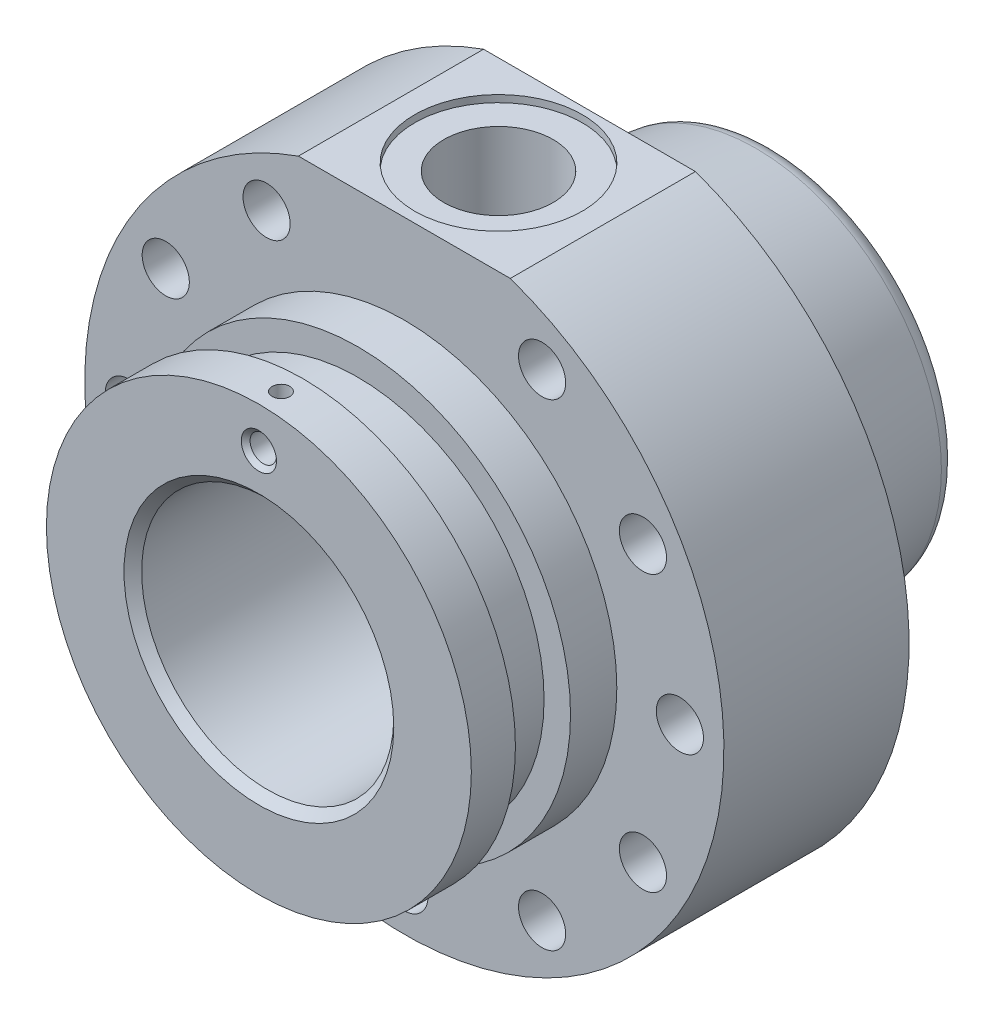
ISO-10303-21;
HEADER;
FILE_DESCRIPTION(('STEP AP214'),'2;1');
FILE_NAME('part.step','',(''),(''),'','','');
FILE_SCHEMA(('AUTOMOTIVE_DESIGN { 1 0 10303 214 1 1 1 1 }'));
ENDSEC;
DATA;
#1=APPLICATION_CONTEXT('core data for automotive mechanical design processes');
#2=APPLICATION_PROTOCOL_DEFINITION('international standard','automotive_design',2000,#1);
#3=PRODUCT_CONTEXT('',#1,'mechanical');
#4=PRODUCT('Part','Part','',(#3));
#5=PRODUCT_RELATED_PRODUCT_CATEGORY('part','',(#4));
#6=PRODUCT_DEFINITION_FORMATION('','',#4);
#7=PRODUCT_DEFINITION_CONTEXT('part definition',#1,'design');
#8=PRODUCT_DEFINITION('design','',#6,#7);
#9=PRODUCT_DEFINITION_SHAPE('','',#8);
#10=(LENGTH_UNIT() NAMED_UNIT(*) SI_UNIT(.MILLI.,.METRE.));
#11=(NAMED_UNIT(*) PLANE_ANGLE_UNIT() SI_UNIT($,.RADIAN.));
#12=(NAMED_UNIT(*) SI_UNIT($,.STERADIAN.) SOLID_ANGLE_UNIT());
#13=UNCERTAINTY_MEASURE_WITH_UNIT(LENGTH_MEASURE(1.E-05),#10,'distance_accuracy_value','');
#14=(GEOMETRIC_REPRESENTATION_CONTEXT(3) GLOBAL_UNCERTAINTY_ASSIGNED_CONTEXT((#13)) GLOBAL_UNIT_ASSIGNED_CONTEXT((#10,
#11,#12)) REPRESENTATION_CONTEXT('',''));
#15=CARTESIAN_POINT('',(0.,0.,0.));
#16=DIRECTION('',(0.,0.,1.));
#17=DIRECTION('',(1.,0.,0.));
#18=AXIS2_PLACEMENT_3D('',#15,#16,#17);
#19=CARTESIAN_POINT('',(0.,0.,75.));
#20=DIRECTION('',(0.,0.,-1.));
#21=DIRECTION('',(-1.,0.,0.));
#22=AXIS2_PLACEMENT_3D('',#19,#20,#21);
#23=CYLINDRICAL_SURFACE('',#22,48.2);
#24=CARTESIAN_POINT('',(0.,0.,75.));
#25=DIRECTION('',(0.,0.,1.));
#26=DIRECTION('',(1.,0.,0.));
#27=AXIS2_PLACEMENT_3D('',#24,#25,#26);
#28=CIRCLE('',#27,48.2);
#29=CARTESIAN_POINT('',(48.2,0.,75.));
#30=VERTEX_POINT('',#29);
#31=EDGE_CURVE('E89',#30,#30,#28,.T.);
#32=ORIENTED_EDGE('',*,*,#31,.F.);
#33=EDGE_LOOP('',(#32));
#34=FACE_BOUND('',#33,.T.);
#35=CARTESIAN_POINT('',(0.,0.,65.));
#36=DIRECTION('',(0.,0.,1.));
#37=DIRECTION('',(1.,0.,0.));
#38=AXIS2_PLACEMENT_3D('',#35,#36,#37);
#39=CIRCLE('',#38,48.2);
#40=CARTESIAN_POINT('',(48.2,0.,65.));
#41=VERTEX_POINT('',#40);
#42=EDGE_CURVE('E148',#41,#41,#39,.T.);
#43=ORIENTED_EDGE('',*,*,#42,.T.);
#44=EDGE_LOOP('',(#43));
#45=FACE_BOUND('',#44,.T.);
#46=CARTESIAN_POINT('',(0.,48.2,68.));
#47=CARTESIAN_POINT('',(-0.112289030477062,48.199999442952,68.0000049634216));
#48=CARTESIAN_POINT('',(-0.224658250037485,48.1996034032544,68.0094883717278));
#49=CARTESIAN_POINT('',(-0.446298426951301,48.1980615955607,68.0471859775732));
#50=CARTESIAN_POINT('',(-0.555565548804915,48.1969149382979,68.0754223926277));
#51=CARTESIAN_POINT('',(-0.767758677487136,48.1940017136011,68.1498176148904));
#52=CARTESIAN_POINT('',(-0.870687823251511,48.1922354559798,68.1959674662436));
#53=CARTESIAN_POINT('',(-1.06730987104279,48.188282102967,68.3048662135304));
#54=CARTESIAN_POINT('',(-1.16100498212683,48.1860951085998,68.3676111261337));
#55=CARTESIAN_POINT('',(-1.33659705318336,48.1815446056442,68.5079714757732));
#56=CARTESIAN_POINT('',(-1.41848640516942,48.1791809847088,68.5855964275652));
#57=CARTESIAN_POINT('',(-1.56807783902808,48.1745445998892,68.7534950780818));
#58=CARTESIAN_POINT('',(-1.63577934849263,48.1722718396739,68.8437692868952));
#59=CARTESIAN_POINT('',(-1.75509157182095,48.1680727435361,69.034440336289));
#60=CARTESIAN_POINT('',(-1.80669675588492,48.1661465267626,69.1348406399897));
#61=CARTESIAN_POINT('',(-1.89231584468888,48.1628590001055,69.3428894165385));
#62=CARTESIAN_POINT('',(-1.92632985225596,48.1614976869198,69.4505378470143));
#63=CARTESIAN_POINT('',(-1.97578207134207,48.1594944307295,69.6699608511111));
#64=CARTESIAN_POINT('',(-1.99123106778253,48.1588520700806,69.7817329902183));
#65=CARTESIAN_POINT('',(-2.00314798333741,48.1583578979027,70.0062858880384));
#66=CARTESIAN_POINT('',(-1.99961601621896,48.1585060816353,70.1190666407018));
#67=CARTESIAN_POINT('',(-1.97368028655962,48.1595758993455,70.34236211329));
#68=CARTESIAN_POINT('',(-1.95128817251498,48.1604970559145,70.4528781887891));
#69=CARTESIAN_POINT('',(-1.88828581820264,48.1630082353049,70.6685813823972));
#70=CARTESIAN_POINT('',(-1.84767551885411,48.1645982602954,70.7737684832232));
#71=CARTESIAN_POINT('',(-1.74937623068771,48.1682685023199,70.9758653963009));
#72=CARTESIAN_POINT('',(-1.69168191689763,48.1703488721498,71.0727726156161));
#73=CARTESIAN_POINT('',(-1.56085623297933,48.1747651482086,71.2555305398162));
#74=CARTESIAN_POINT('',(-1.48772478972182,48.177101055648,71.3413811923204));
#75=CARTESIAN_POINT('',(-1.32803497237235,48.1817672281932,71.4996568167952));
#76=CARTESIAN_POINT('',(-1.2414665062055,48.18409748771,71.5720716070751));
#77=CARTESIAN_POINT('',(-1.0573955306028,48.1884879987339,71.7013414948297));
#78=CARTESIAN_POINT('',(-0.959893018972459,48.1905482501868,71.7581965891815));
#79=CARTESIAN_POINT('',(-0.756715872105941,48.1941665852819,71.8547321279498));
#80=CARTESIAN_POINT('',(-0.651041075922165,48.1957246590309,71.894412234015));
#81=CARTESIAN_POINT('',(-0.434521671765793,48.1981628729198,71.9554648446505));
#82=CARTESIAN_POINT('',(-0.323677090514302,48.1990430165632,71.976837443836));
#83=CARTESIAN_POINT('',(-0.100053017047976,48.2000257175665,72.000655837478));
#84=CARTESIAN_POINT('',(0.0127249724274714,48.2001288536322,72.0031157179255));
#85=CARTESIAN_POINT('',(0.237092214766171,48.1995474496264,71.9890755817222));
#86=CARTESIAN_POINT('',(0.348681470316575,48.1988629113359,71.9725756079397));
#87=CARTESIAN_POINT('',(0.567464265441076,48.196783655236,71.9210957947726));
#88=CARTESIAN_POINT('',(0.674659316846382,48.1953891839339,71.8861223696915));
#89=CARTESIAN_POINT('',(0.881657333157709,48.1920471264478,71.7986949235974));
#90=CARTESIAN_POINT('',(0.981460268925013,48.1900995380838,71.7462408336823));
#91=CARTESIAN_POINT('',(1.17090577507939,48.1858690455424,71.6253048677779));
#92=CARTESIAN_POINT('',(1.26054230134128,48.1835859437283,71.5568135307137));
#93=CARTESIAN_POINT('',(1.42704979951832,48.1789422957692,71.4057611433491));
#94=CARTESIAN_POINT('',(1.50392071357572,48.1765817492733,71.3232000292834));
#95=CARTESIAN_POINT('',(1.64276214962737,48.1720476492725,71.1462912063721));
#96=CARTESIAN_POINT('',(1.70472357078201,48.1698742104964,71.0519363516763));
#97=CARTESIAN_POINT('',(1.81192497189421,48.1659611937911,70.8541546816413));
#98=CARTESIAN_POINT('',(1.85716500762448,48.1642216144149,70.7507278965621));
#99=CARTESIAN_POINT('',(1.92962352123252,48.1613732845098,70.5377722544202));
#100=CARTESIAN_POINT('',(1.9568478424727,48.1602643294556,70.4282453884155));
#101=CARTESIAN_POINT('',(1.9925212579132,48.1588017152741,70.2061706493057));
#102=CARTESIAN_POINT('',(2.00097041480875,48.1584480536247,70.0936227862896));
#103=CARTESIAN_POINT('',(1.99885299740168,48.1585359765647,69.8687916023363));
#104=CARTESIAN_POINT('',(1.988300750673,48.1589769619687,69.7565081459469));
#105=CARTESIAN_POINT('',(1.94850962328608,48.160603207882,69.5353082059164));
#106=CARTESIAN_POINT('',(1.9192707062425,48.1617884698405,69.4263917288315));
#107=CARTESIAN_POINT('',(1.84293886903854,48.1647695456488,69.2150137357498));
#108=CARTESIAN_POINT('',(1.79584571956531,48.1665653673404,69.1125523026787));
#109=CARTESIAN_POINT('',(1.68514532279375,48.1705650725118,68.9169905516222));
#110=CARTESIAN_POINT('',(1.62153862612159,48.172768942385,68.8238899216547));
#111=CARTESIAN_POINT('',(1.47956766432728,48.177338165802,68.6496224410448));
#112=CARTESIAN_POINT('',(1.40119388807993,48.1797036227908,68.5684633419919));
#113=CARTESIAN_POINT('',(1.23191082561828,48.1843288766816,68.4204306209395));
#114=CARTESIAN_POINT('',(1.1409984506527,48.1865886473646,68.3535605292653));
#115=CARTESIAN_POINT('',(0.949165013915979,48.1907490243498,68.2359825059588));
#116=CARTESIAN_POINT('',(0.848235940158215,48.1926493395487,68.185287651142));
#117=CARTESIAN_POINT('',(0.639367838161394,48.195871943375,68.1016226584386));
#118=CARTESIAN_POINT('',(0.531437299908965,48.1971949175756,68.0686314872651));
#119=CARTESIAN_POINT('',(0.352358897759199,48.198762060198,68.0300075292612));
#120=CARTESIAN_POINT('',(0.28237217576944,48.1992242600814,68.0187689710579));
#121=CARTESIAN_POINT('',(0.141600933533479,48.199843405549,68.0037636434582));
#122=CARTESIAN_POINT('',(0.0708164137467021,48.200000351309,67.9999968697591));
#123=CARTESIAN_POINT('',(0.,48.2,68.));
#124=B_SPLINE_CURVE_WITH_KNOTS('',3,(#46,#47,#48,#49,#50,#51,#52,#53,#54,#55,#56,#57,#58,#59,
#60,#61,#62,#63,#64,#65,#66,#67,#68,#69,#70,#71,#72,#73,#74,#75,#76,#77,#78,#79,#80,#81,#82,#83,
#84,#85,#86,#87,#88,#89,#90,#91,#92,#93,#94,#95,#96,#97,#98,#99,#100,#101,#102,#103,#104,#105,
#106,#107,#108,#109,#110,#111,#112,#113,#114,#115,#116,#117,#118,#119,#120,#121,#122,#123),
.UNSPECIFIED.,.T.,.F.,(4,2,2,2,2,2,2,2,2,2,2,2,2,2,2,2,2,2,2,2,2,2,2,2,2,2,2,2,2,2,2,2,2,2,2,2,
2,2,4),(0.,0.336608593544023,0.673616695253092,1.01045652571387,1.34721557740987,
1.68419068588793,2.02117938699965,2.35828373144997,2.69538610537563,3.03229255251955,
3.36919698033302,3.70589348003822,4.04259107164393,4.37939372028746,4.71619796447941,
5.05325640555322,5.39031491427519,5.7273800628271,6.06444346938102,6.40125581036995,
6.73806738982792,7.07476209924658,7.41145813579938,7.74835330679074,8.08525000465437,
8.42235182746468,8.7594525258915,9.09644383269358,9.43343401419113,9.77017020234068,
10.1069070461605,10.4436482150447,10.7803781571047,11.1173257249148,11.4543564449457,
11.7916589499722,12.1285598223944,12.3408461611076,12.553132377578),.UNSPECIFIED.);
#125=CARTESIAN_POINT('',(0.,48.2,68.));
#126=VERTEX_POINT('',#125);
#127=EDGE_CURVE('E330',#126,#126,#124,.T.);
#128=ORIENTED_EDGE('',*,*,#127,.F.);
#129=EDGE_LOOP('',(#128));
#130=FACE_BOUND('',#129,.T.);
#131=ADVANCED_FACE('F41',(#34,#45,#130),#23,.T.);
#132=CARTESIAN_POINT('',(0.,39.,-42.001));
#133=DIRECTION('',(0.,0.,1.));
#134=DIRECTION('',(1.,0.,0.));
#135=AXIS2_PLACEMENT_3D('',#132,#133,#134);
#136=CYLINDRICAL_SURFACE('',#135,3.);
#137=CARTESIAN_POINT('',(0.,39.,74.));
#138=DIRECTION('',(0.,0.,1.));
#139=DIRECTION('',(1.,0.,0.));
#140=AXIS2_PLACEMENT_3D('',#137,#138,#139);
#141=CIRCLE('',#140,3.);
#142=CARTESIAN_POINT('',(3.,39.,74.));
#143=VERTEX_POINT('',#142);
#144=EDGE_CURVE('E57',#143,#143,#141,.T.);
#145=ORIENTED_EDGE('',*,*,#144,.T.);
#146=EDGE_LOOP('',(#145));
#147=FACE_BOUND('',#146,.T.);
#148=CARTESIAN_POINT('',(3.,39.,27.5142217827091));
#149=CARTESIAN_POINT('',(2.99999310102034,38.8393144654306,27.5142285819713));
#150=CARTESIAN_POINT('',(2.9870126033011,38.6783605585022,27.5199347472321));
#151=CARTESIAN_POINT('',(2.93560066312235,38.3610913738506,27.5420244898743));
#152=CARTESIAN_POINT('',(2.89710418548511,38.2047890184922,27.5584353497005));
#153=CARTESIAN_POINT('',(2.79635331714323,37.9019222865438,27.5997644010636));
#154=CARTESIAN_POINT('',(2.73418843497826,37.7553236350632,27.6246505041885));
#155=CARTESIAN_POINT('',(2.58813019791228,37.4746719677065,27.6800783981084));
#156=CARTESIAN_POINT('',(2.5042415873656,37.3406162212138,27.7106189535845));
#157=CARTESIAN_POINT('',(2.31198302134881,37.0811095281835,27.7758711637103));
#158=CARTESIAN_POINT('',(2.20256905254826,36.9564654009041,27.8107169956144));
#159=CARTESIAN_POINT('',(1.96456364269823,36.7267064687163,27.8795451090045));
#160=CARTESIAN_POINT('',(1.8359655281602,36.6215984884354,27.9135270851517));
#161=CARTESIAN_POINT('',(1.55700947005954,36.4298904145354,27.9784093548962));
#162=CARTESIAN_POINT('',(1.40599344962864,36.3441835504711,28.0091352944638));
#163=CARTESIAN_POINT('',(1.09023798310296,36.1997346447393,28.062417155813));
#164=CARTESIAN_POINT('',(0.925504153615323,36.1409816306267,28.084976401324));
#165=CARTESIAN_POINT('',(0.595449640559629,36.0549877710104,28.1184331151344));
#166=CARTESIAN_POINT('',(0.430543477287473,36.0263590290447,28.1298422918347));
#167=CARTESIAN_POINT('',(0.097899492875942,35.9969572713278,28.1415629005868));
#168=CARTESIAN_POINT('',(-0.0698372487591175,35.9961738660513,28.1418784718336));
#169=CARTESIAN_POINT('',(-0.393348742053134,36.0217241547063,28.1316876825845));
#170=CARTESIAN_POINT('',(-0.549266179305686,36.0465371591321,28.1217881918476));
#171=CARTESIAN_POINT('',(-0.854509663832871,36.1199893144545,28.0930976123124));
#172=CARTESIAN_POINT('',(-1.00383522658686,36.1686302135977,28.0743058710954));
#173=CARTESIAN_POINT('',(-1.29434690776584,36.2889547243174,28.0293106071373));
#174=CARTESIAN_POINT('',(-1.43537643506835,36.3609745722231,28.0029996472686));
#175=CARTESIAN_POINT('',(-1.70371222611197,36.5256975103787,27.9455770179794));
#176=CARTESIAN_POINT('',(-1.83101376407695,36.6184076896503,27.9144637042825));
#177=CARTESIAN_POINT('',(-2.07715324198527,36.8289737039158,27.8481827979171));
#178=CARTESIAN_POINT('',(-2.19488676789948,36.9480808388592,27.8128831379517));
#179=CARTESIAN_POINT('',(-2.40916112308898,37.204485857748,27.7437831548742));
#180=CARTESIAN_POINT('',(-2.50569501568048,37.3417896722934,27.7099833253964));
#181=CARTESIAN_POINT('',(-2.67735628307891,37.6356285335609,27.6468117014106));
#182=CARTESIAN_POINT('',(-2.75180197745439,37.792597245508,27.6175919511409));
#183=CARTESIAN_POINT('',(-2.87276438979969,38.1183232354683,27.5686720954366));
#184=CARTESIAN_POINT('',(-2.91929924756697,38.2870727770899,27.548965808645));
#185=CARTESIAN_POINT('',(-2.98043242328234,38.6205536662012,27.522804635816));
#186=CARTESIAN_POINT('',(-2.99680814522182,38.7849006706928,27.5156137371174));
#187=CARTESIAN_POINT('',(-3.00234198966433,39.1141158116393,27.5132007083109));
#188=CARTESIAN_POINT('',(-2.99150836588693,39.2789837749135,27.5179749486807));
#189=CARTESIAN_POINT('',(-2.94454934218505,39.5946884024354,27.538198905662));
#190=CARTESIAN_POINT('',(-2.90989959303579,39.7457894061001,27.5530251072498));
#191=CARTESIAN_POINT('',(-2.81820628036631,40.0399326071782,27.5909090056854));
#192=CARTESIAN_POINT('',(-2.76115775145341,40.1829730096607,27.6139685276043));
#193=CARTESIAN_POINT('',(-2.62370345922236,40.4634035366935,27.6668649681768));
#194=CARTESIAN_POINT('',(-2.54244430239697,40.6003292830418,27.696938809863));
#195=CARTESIAN_POINT('',(-2.35974783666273,40.8592244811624,27.7601140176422));
#196=CARTESIAN_POINT('',(-2.25830231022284,40.9811878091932,27.793216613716));
#197=CARTESIAN_POINT('',(-2.02926631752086,41.2160601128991,27.8616719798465));
#198=CARTESIAN_POINT('',(-1.90029814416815,41.3276348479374,27.8970103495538));
#199=CARTESIAN_POINT('',(-1.62462545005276,41.5277656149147,27.9636551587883));
#200=CARTESIAN_POINT('',(-1.47792020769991,41.6163207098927,27.9949614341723));
#201=CARTESIAN_POINT('',(-1.17041990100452,41.767571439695,28.0501139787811));
#202=CARTESIAN_POINT('',(-1.00962822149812,41.8302732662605,28.0739620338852));
#203=CARTESIAN_POINT('',(-0.67859038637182,41.9273232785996,28.1114489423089));
#204=CARTESIAN_POINT('',(-0.508349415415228,41.961686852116,28.1250933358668));
#205=CARTESIAN_POINT('',(-0.175224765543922,41.9992570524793,28.1400433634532));
#206=CARTESIAN_POINT('',(-0.0125857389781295,42.004350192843,28.1420959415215));
#207=CARTESIAN_POINT('',(0.311150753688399,41.9882167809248,28.1356488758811));
#208=CARTESIAN_POINT('',(0.47224844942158,41.9669942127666,28.1271508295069));
#209=CARTESIAN_POINT('',(0.783256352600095,41.9001798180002,28.1009309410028));
#210=CARTESIAN_POINT('',(0.9333582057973,41.8553565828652,28.0835004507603));
#211=CARTESIAN_POINT('',(1.2238835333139,41.7434207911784,28.0412824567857));
#212=CARTESIAN_POINT('',(1.36430521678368,41.6763041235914,28.0164935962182));
#213=CARTESIAN_POINT('',(1.63830455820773,41.5183452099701,27.9606296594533));
#214=CARTESIAN_POINT('',(1.77130556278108,41.4265855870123,27.9293252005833));
#215=CARTESIAN_POINT('',(2.0205810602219,41.2233171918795,27.8641992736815));
#216=CARTESIAN_POINT('',(2.13684859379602,41.1118002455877,27.8303767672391));
#217=CARTESIAN_POINT('',(2.35680182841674,40.864027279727,27.7614247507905));
#218=CARTESIAN_POINT('',(2.45926306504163,40.7266671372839,27.7263439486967));
#219=CARTESIAN_POINT('',(2.63977144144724,40.4355863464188,27.6611030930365));
#220=CARTESIAN_POINT('',(2.71781571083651,40.2818637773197,27.630943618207));
#221=CARTESIAN_POINT('',(2.84098572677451,39.9764457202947,27.5817419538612));
#222=CARTESIAN_POINT('',(2.88843803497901,39.8258075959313,27.5619446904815));
#223=CARTESIAN_POINT('',(2.95907986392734,39.518266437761,27.5320456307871));
#224=CARTESIAN_POINT('',(2.98233699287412,39.3613821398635,27.5219168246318));
#225=CARTESIAN_POINT('',(2.99538303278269,39.1698326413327,27.5162346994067));
#226=CARTESIAN_POINT('',(2.99711296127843,39.1358977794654,27.5154812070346));
#227=CARTESIAN_POINT('',(2.99942221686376,39.0679792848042,27.5144740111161));
#228=CARTESIAN_POINT('',(3.0000014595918,39.0339956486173,27.5142203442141));
#229=CARTESIAN_POINT('',(3.,39.,27.5142217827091));
#230=B_SPLINE_CURVE_WITH_KNOTS('',3,(#148,#149,#150,#151,#152,#153,#154,#155,#156,#157,#158,
#159,#160,#161,#162,#163,#164,#165,#166,#167,#168,#169,#170,#171,#172,#173,#174,#175,#176,#177,
#178,#179,#180,#181,#182,#183,#184,#185,#186,#187,#188,#189,#190,#191,#192,#193,#194,#195,#196,
#197,#198,#199,#200,#201,#202,#203,#204,#205,#206,#207,#208,#209,#210,#211,#212,#213,#214,#215,
#216,#217,#218,#219,#220,#221,#222,#223,#224,#225,#226,#227,#228,#229),.UNSPECIFIED.,.T.,.F.,(4,
2,2,2,2,2,2,2,2,2,2,2,2,2,2,2,2,2,2,2,2,2,2,2,2,2,2,2,2,2,2,2,2,2,2,2,2,2,2,2,4),(0.,
0.481916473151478,0.96506600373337,1.44640623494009,1.92764143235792,2.43383427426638,
2.94020361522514,3.46654003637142,3.99266200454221,4.49331274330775,4.99377667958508,
5.46612967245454,5.9385173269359,6.41802450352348,6.89769622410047,7.40886066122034,
7.92019210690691,8.44596688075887,8.97139957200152,9.4647322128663,9.95791522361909,
10.4230087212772,10.8882053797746,11.3722673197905,11.8565267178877,12.3765560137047,
12.8966064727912,13.4165323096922,13.936175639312,14.4219155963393,14.907582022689,
15.3783299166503,15.8491646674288,16.3408057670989,16.8326507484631,17.3549437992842,
17.8772982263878,18.3527499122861,18.8268694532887,18.928819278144,19.0307765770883),.UNSPECIFIED.);
#231=CARTESIAN_POINT('',(3.,39.,27.5142217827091));
#232=VERTEX_POINT('',#231);
#233=EDGE_CURVE('E328',#232,#232,#230,.T.);
#234=ORIENTED_EDGE('',*,*,#233,.T.);
#235=EDGE_LOOP('',(#234));
#236=FACE_BOUND('',#235,.T.);
#237=CARTESIAN_POINT('',(0.,42.,68.));
#238=CARTESIAN_POINT('',(0.100484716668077,42.0000004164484,67.9999994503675));
#239=CARTESIAN_POINT('',(0.200969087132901,41.9949080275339,68.0076139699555));
#240=CARTESIAN_POINT('',(0.39873305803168,41.9750465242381,68.0375968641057));
#241=CARTESIAN_POINT('',(0.496011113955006,41.9602728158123,68.0599722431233));
#242=CARTESIAN_POINT('',(0.684212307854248,41.9225048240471,68.1181077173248));
#243=CARTESIAN_POINT('',(0.775162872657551,41.8995490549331,68.1538051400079));
#244=CARTESIAN_POINT('',(0.949415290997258,41.8472613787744,68.2370633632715));
#245=CARTESIAN_POINT('',(1.03271603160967,41.8179285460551,68.2846258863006));
#246=CARTESIAN_POINT('',(1.19728470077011,41.7522732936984,68.3946569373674));
#247=CARTESIAN_POINT('',(1.27778030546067,41.7155689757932,68.4580478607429));
#248=CARTESIAN_POINT('',(1.42772804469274,41.6398231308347,68.5957300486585));
#249=CARTESIAN_POINT('',(1.49716405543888,41.6007783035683,68.6700369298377));
#250=CARTESIAN_POINT('',(1.63422297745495,41.5172826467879,68.8410523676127));
#251=CARTESIAN_POINT('',(1.69983186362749,41.472950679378,68.9394456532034));
#252=CARTESIAN_POINT('',(1.81350357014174,41.3908414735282,69.1483633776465));
#253=CARTESIAN_POINT('',(1.86159673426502,41.3530529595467,69.2588664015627));
#254=CARTESIAN_POINT('',(1.92674035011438,41.2997626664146,69.4567112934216));
#255=CARTESIAN_POINT('',(1.94874447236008,41.280976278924,69.5415284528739));
#256=CARTESIAN_POINT('',(1.98150617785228,41.2525796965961,69.7147445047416));
#257=CARTESIAN_POINT('',(1.99228314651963,41.2429536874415,69.803136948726));
#258=CARTESIAN_POINT('',(2.00191364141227,41.2343660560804,69.9814747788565));
#259=CARTESIAN_POINT('',(2.00071842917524,41.235448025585,70.0714250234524));
#260=CARTESIAN_POINT('',(1.98637581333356,41.2481977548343,70.2496349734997));
#261=CARTESIAN_POINT('',(1.97321828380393,41.2598744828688,70.3378931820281));
#262=CARTESIAN_POINT('',(1.93664994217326,41.2912718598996,70.5064670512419));
#263=CARTESIAN_POINT('',(1.91371711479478,41.3106148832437,70.5869613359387));
#264=CARTESIAN_POINT('',(1.85870118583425,41.3550962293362,70.7430236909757));
#265=CARTESIAN_POINT('',(1.82661507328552,41.3802364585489,70.8185901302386));
#266=CARTESIAN_POINT('',(1.7467381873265,41.4396419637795,70.9790253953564));
#267=CARTESIAN_POINT('',(1.69708052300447,41.4747231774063,71.0626599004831));
#268=CARTESIAN_POINT('',(1.58668960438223,41.5469153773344,71.2213833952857));
#269=CARTESIAN_POINT('',(1.52594268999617,41.5840288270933,71.2964616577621));
#270=CARTESIAN_POINT('',(1.37981165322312,41.6654334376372,71.4525425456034));
#271=CARTESIAN_POINT('',(1.29193938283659,41.7095474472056,71.5313340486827));
#272=CARTESIAN_POINT('',(1.10200799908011,41.7921810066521,71.6731964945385));
#273=CARTESIAN_POINT('',(0.99996229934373,41.8307057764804,71.736282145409));
#274=CARTESIAN_POINT('',(0.804857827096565,41.8914540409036,71.8334777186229));
#275=CARTESIAN_POINT('',(0.713957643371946,41.9153926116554,71.8708433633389));
#276=CARTESIAN_POINT('',(0.526036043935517,41.955077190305,71.9321049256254));
#277=CARTESIAN_POINT('',(0.429019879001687,41.9708301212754,71.9560122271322));
#278=CARTESIAN_POINT('',(0.230985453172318,41.9927588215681,71.989161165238));
#279=CARTESIAN_POINT('',(0.129951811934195,41.9988932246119,71.9983394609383));
#280=CARTESIAN_POINT('',(-0.0724415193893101,42.0008311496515,72.0012470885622));
#281=CARTESIAN_POINT('',(-0.173801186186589,41.9966353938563,71.9949775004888));
#282=CARTESIAN_POINT('',(-0.366455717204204,41.9789958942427,71.9683759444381));
#283=CARTESIAN_POINT('',(-0.457957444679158,41.9662224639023,71.9490627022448));
#284=CARTESIAN_POINT('',(-0.636116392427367,41.9331844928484,71.8984043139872));
#285=CARTESIAN_POINT('',(-0.7227728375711,41.9129187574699,71.8670572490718));
#286=CARTESIAN_POINT('',(-0.894664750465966,41.8649635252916,71.7913477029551));
#287=CARTESIAN_POINT('',(-0.979496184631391,41.8368987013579,71.7463118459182));
#288=CARTESIAN_POINT('',(-1.14068302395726,41.7760185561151,71.6455667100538));
#289=CARTESIAN_POINT('',(-1.21703314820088,41.7432003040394,71.5898508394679));
#290=CARTESIAN_POINT('',(-1.37185445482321,41.6695454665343,71.4593921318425));
#291=CARTESIAN_POINT('',(-1.44875187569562,41.6282615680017,71.383033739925));
#292=CARTESIAN_POINT('',(-1.58933968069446,41.5457117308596,71.2188885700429));
#293=CARTESIAN_POINT('',(-1.65302093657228,41.5044458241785,71.1310939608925));
#294=CARTESIAN_POINT('',(-1.76124776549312,41.4293967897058,70.9528575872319));
#295=CARTESIAN_POINT('',(-1.80695636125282,41.395275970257,70.8632679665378));
#296=CARTESIAN_POINT('',(-1.88496213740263,41.3343897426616,70.6761273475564));
#297=CARTESIAN_POINT('',(-1.91728345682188,41.3076111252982,70.5785910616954));
#298=CARTESIAN_POINT('',(-1.96235843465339,41.2693320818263,70.3954355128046));
#299=CARTESIAN_POINT('',(-1.97758597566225,41.2559499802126,70.310828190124));
#300=CARTESIAN_POINT('',(-1.99699205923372,41.238794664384,70.1394267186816));
#301=CARTESIAN_POINT('',(-2.00118260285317,41.2350110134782,70.0526350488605));
#302=CARTESIAN_POINT('',(-1.99823921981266,41.2376420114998,69.8793569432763));
#303=CARTESIAN_POINT('',(-1.99109858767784,41.2440626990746,69.7928707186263));
#304=CARTESIAN_POINT('',(-1.96596997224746,41.2661045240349,69.6226564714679));
#305=CARTESIAN_POINT('',(-1.94796751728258,41.2817379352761,69.5389322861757));
#306=CARTESIAN_POINT('',(-1.89593035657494,41.325268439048,69.3542888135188));
#307=CARTESIAN_POINT('',(-1.85890187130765,41.3553233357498,69.2547322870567));
#308=CARTESIAN_POINT('',(-1.77084526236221,41.4222216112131,69.0645131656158));
#309=CARTESIAN_POINT('',(-1.71979748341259,41.459074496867,68.9738633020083));
#310=CARTESIAN_POINT('',(-1.60398280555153,41.5361718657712,68.8007181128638));
#311=CARTESIAN_POINT('',(-1.53898309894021,41.5764658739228,68.718401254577));
#312=CARTESIAN_POINT('',(-1.39671768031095,41.6562830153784,68.5646775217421));
#313=CARTESIAN_POINT('',(-1.31944821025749,41.695805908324,68.4932740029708));
#314=CARTESIAN_POINT('',(-1.14145732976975,41.7763155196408,68.3532878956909));
#315=CARTESIAN_POINT('',(-1.03896166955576,41.8166980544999,68.2865813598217));
#316=CARTESIAN_POINT('',(-0.820868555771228,41.8877766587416,68.1720867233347));
#317=CARTESIAN_POINT('',(-0.705292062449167,41.9184879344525,68.1242688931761));
#318=CARTESIAN_POINT('',(-0.491435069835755,41.961016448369,68.0588454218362));
#319=CARTESIAN_POINT('',(-0.39501232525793,41.9755148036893,68.0368889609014));
#320=CARTESIAN_POINT('',(-0.199058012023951,41.9950028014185,68.0074719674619));
#321=CARTESIAN_POINT('',(-0.0995288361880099,41.9999995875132,68.000000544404));
#322=CARTESIAN_POINT('',(0.,42.,68.));
#323=B_SPLINE_CURVE_WITH_KNOTS('',3,(#237,#238,#239,#240,#241,#242,#243,#244,#245,#246,#247,
#248,#249,#250,#251,#252,#253,#254,#255,#256,#257,#258,#259,#260,#261,#262,#263,#264,#265,#266,
#267,#268,#269,#270,#271,#272,#273,#274,#275,#276,#277,#278,#279,#280,#281,#282,#283,#284,#285,
#286,#287,#288,#289,#290,#291,#292,#293,#294,#295,#296,#297,#298,#299,#300,#301,#302,#303,#304,
#305,#306,#307,#308,#309,#310,#311,#312,#313,#314,#315,#316,#317,#318,#319,#320,#321,#322),
.UNSPECIFIED.,.T.,.F.,(4,2,2,2,2,2,2,2,2,2,2,2,2,2,2,2,2,2,2,2,2,2,2,2,2,2,2,2,2,2,2,2,2,2,2,2,
2,2,2,2,2,2,4),(0.,0.301053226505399,0.602249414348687,0.902046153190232,1.20188643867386,
1.52717029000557,1.85292411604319,2.23006683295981,2.60655305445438,2.87433693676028,
3.14165767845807,3.41006711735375,3.67870397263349,3.93548862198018,4.19235783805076,
4.50147574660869,4.81097703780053,5.18718954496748,5.56304840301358,5.86524087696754,
6.16717735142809,6.47040883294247,6.77361911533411,7.05553084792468,7.33748755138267,
7.63652346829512,7.93574454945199,8.28228176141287,8.62905753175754,8.94649935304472,
9.26336626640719,9.52324048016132,9.78283200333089,10.0425772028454,10.302669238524,
10.6320660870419,10.9619271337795,11.2977924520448,11.6337608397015,12.0179535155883,
12.4015390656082,12.6999529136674,12.9981423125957),.UNSPECIFIED.);
#324=CARTESIAN_POINT('',(0.,42.,68.));
#325=VERTEX_POINT('',#324);
#326=EDGE_CURVE('E46',#325,#325,#323,.T.);
#327=ORIENTED_EDGE('',*,*,#326,.F.);
#328=EDGE_LOOP('',(#327));
#329=FACE_BOUND('',#328,.T.);
#330=ADVANCED_FACE('F172',(#147,#236,#329),#136,.F.);
#331=CARTESIAN_POINT('',(0.,0.,42.));
#332=DIRECTION('',(0.,0.,-1.));
#333=DIRECTION('',(-1.,0.,0.));
#334=AXIS2_PLACEMENT_3D('',#331,#332,#333);
#335=CYLINDRICAL_SURFACE('',#334,72.5);
#336=DIRECTION('',(0.,0.,-1.));
#337=VECTOR('',#336,1.);
#338=CARTESIAN_POINT('',(24.0351825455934,68.4,42.));
#339=LINE('',#338,#337);
#340=CARTESIAN_POINT('',(24.0351825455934,68.4,42.));
#341=VERTEX_POINT('',#340);
#342=CARTESIAN_POINT('',(24.0351825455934,68.4,0.));
#343=VERTEX_POINT('',#342);
#344=EDGE_CURVE('E65',#341,#343,#339,.T.);
#345=ORIENTED_EDGE('',*,*,#344,.F.);
#346=CARTESIAN_POINT('',(0.,0.,42.));
#347=DIRECTION('',(0.,0.,1.));
#348=DIRECTION('',(1.,0.,0.));
#349=AXIS2_PLACEMENT_3D('',#346,#347,#348);
#350=CIRCLE('',#349,72.5);
#351=CARTESIAN_POINT('',(-24.0351825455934,68.4,42.));
#352=VERTEX_POINT('',#351);
#353=EDGE_CURVE('E88',#352,#341,#350,.T.);
#354=ORIENTED_EDGE('',*,*,#353,.F.);
#355=DIRECTION('',(0.,0.,-1.));
#356=VECTOR('',#355,1.);
#357=CARTESIAN_POINT('',(-24.0351825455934,68.4,42.));
#358=LINE('',#357,#356);
#359=CARTESIAN_POINT('',(-24.0351825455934,68.4,0.));
#360=VERTEX_POINT('',#359);
#361=EDGE_CURVE('E73',#360,#352,#358,.F.);
#362=ORIENTED_EDGE('',*,*,#361,.F.);
#363=CARTESIAN_POINT('',(0.,0.,0.));
#364=DIRECTION('',(0.,0.,1.));
#365=DIRECTION('',(1.,0.,0.));
#366=AXIS2_PLACEMENT_3D('',#363,#364,#365);
#367=CIRCLE('',#366,72.5);
#368=EDGE_CURVE('E84',#360,#343,#367,.T.);
#369=ORIENTED_EDGE('',*,*,#368,.T.);
#370=EDGE_LOOP('',(#345,#354,#362,#369));
#371=FACE_BOUND('',#370,.T.);
#372=ADVANCED_FACE('F81',(#371),#335,.T.);
#373=CARTESIAN_POINT('',(0.,0.,42.));
#374=DIRECTION('',(0.,0.,1.));
#375=DIRECTION('',(1.,0.,0.));
#376=AXIS2_PLACEMENT_3D('',#373,#374,#375);
#377=PLANE('',#376);
#378=CARTESIAN_POINT('',(54.1265877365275,31.2499999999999,42.));
#379=DIRECTION('',(0.,0.,1.));
#380=DIRECTION('',(0.499999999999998,-0.86602540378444,0.));
#381=AXIS2_PLACEMENT_3D('',#378,#379,#380);
#382=CIRCLE('',#381,5.35);
#383=CARTESIAN_POINT('',(59.4765877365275,31.2499999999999,42.));
#384=VERTEX_POINT('',#383);
#385=EDGE_CURVE('E389',#384,#384,#382,.T.);
#386=ORIENTED_EDGE('',*,*,#385,.F.);
#387=EDGE_LOOP('',(#386));
#388=FACE_BOUND('',#387,.T.);
#389=CARTESIAN_POINT('',(62.5,-2.18217583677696E-13,42.));
#390=DIRECTION('',(0.,0.,1.));
#391=DIRECTION('',(0.,-1.,0.));
#392=AXIS2_PLACEMENT_3D('',#389,#390,#391);
#393=CIRCLE('',#392,5.35);
#394=CARTESIAN_POINT('',(67.85,-2.18217583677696E-13,42.));
#395=VERTEX_POINT('',#394);
#396=EDGE_CURVE('E394',#395,#395,#393,.T.);
#397=ORIENTED_EDGE('',*,*,#396,.F.);
#398=EDGE_LOOP('',(#397));
#399=FACE_BOUND('',#398,.T.);
#400=CARTESIAN_POINT('',(54.1265877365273,-31.2500000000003,42.));
#401=DIRECTION('',(0.,0.,1.));
#402=DIRECTION('',(-0.500000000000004,-0.866025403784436,0.));
#403=AXIS2_PLACEMENT_3D('',#400,#401,#402);
#404=CIRCLE('',#403,5.35);
#405=CARTESIAN_POINT('',(59.4765877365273,-31.2500000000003,42.));
#406=VERTEX_POINT('',#405);
#407=EDGE_CURVE('E398',#406,#406,#404,.T.);
#408=ORIENTED_EDGE('',*,*,#407,.F.);
#409=EDGE_LOOP('',(#408));
#410=FACE_BOUND('',#409,.T.);
#411=CARTESIAN_POINT('',(31.2499999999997,-54.1265877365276,42.));
#412=DIRECTION('',(0.,0.,1.));
#413=DIRECTION('',(-0.866025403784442,-0.499999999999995,0.));
#414=AXIS2_PLACEMENT_3D('',#411,#412,#413);
#415=CIRCLE('',#414,5.35);
#416=CARTESIAN_POINT('',(36.5999999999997,-54.1265877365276,42.));
#417=VERTEX_POINT('',#416);
#418=EDGE_CURVE('E397',#417,#417,#415,.T.);
#419=ORIENTED_EDGE('',*,*,#418,.F.);
#420=EDGE_LOOP('',(#419));
#421=FACE_BOUND('',#420,.T.);
#422=CARTESIAN_POINT('',(0.,-62.5,42.));
#423=DIRECTION('',(0.,0.,1.));
#424=DIRECTION('',(-1.,0.,0.));
#425=AXIS2_PLACEMENT_3D('',#422,#423,#424);
#426=CIRCLE('',#425,5.35);
#427=CARTESIAN_POINT('',(5.35,-62.5,42.));
#428=VERTEX_POINT('',#427);
#429=EDGE_CURVE('E404',#428,#428,#426,.T.);
#430=ORIENTED_EDGE('',*,*,#429,.F.);
#431=EDGE_LOOP('',(#430));
#432=FACE_BOUND('',#431,.T.);
#433=CARTESIAN_POINT('',(-31.2500000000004,-54.1265877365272,42.));
#434=DIRECTION('',(0.,0.,1.));
#435=DIRECTION('',(-0.866025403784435,0.500000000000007,0.));
#436=AXIS2_PLACEMENT_3D('',#433,#434,#435);
#437=CIRCLE('',#436,5.35);
#438=CARTESIAN_POINT('',(-25.9000000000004,-54.1265877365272,42.));
#439=VERTEX_POINT('',#438);
#440=EDGE_CURVE('E410',#439,#439,#437,.T.);
#441=ORIENTED_EDGE('',*,*,#440,.F.);
#442=EDGE_LOOP('',(#441));
#443=FACE_BOUND('',#442,.T.);
#444=CARTESIAN_POINT('',(-54.1265877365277,-31.2499999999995,42.));
#445=DIRECTION('',(0.,0.,1.));
#446=DIRECTION('',(-0.499999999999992,0.866025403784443,0.));
#447=AXIS2_PLACEMENT_3D('',#444,#445,#446);
#448=CIRCLE('',#447,5.35);
#449=CARTESIAN_POINT('',(-48.7765877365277,-31.2499999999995,42.));
#450=VERTEX_POINT('',#449);
#451=EDGE_CURVE('E415',#450,#450,#448,.T.);
#452=ORIENTED_EDGE('',*,*,#451,.F.);
#453=EDGE_LOOP('',(#452));
#454=FACE_BOUND('',#453,.T.);
#455=CARTESIAN_POINT('',(-62.5,6.54652751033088E-13,42.));
#456=DIRECTION('',(0.,0.,1.));
#457=DIRECTION('',(0.,1.,0.));
#458=AXIS2_PLACEMENT_3D('',#455,#456,#457);
#459=CIRCLE('',#458,5.35);
#460=CARTESIAN_POINT('',(-57.15,6.54652751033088E-13,42.));
#461=VERTEX_POINT('',#460);
#462=EDGE_CURVE('E418',#461,#461,#459,.T.);
#463=ORIENTED_EDGE('',*,*,#462,.F.);
#464=EDGE_LOOP('',(#463));
#465=FACE_BOUND('',#464,.T.);
#466=CARTESIAN_POINT('',(-54.126587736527,31.2500000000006,42.));
#467=DIRECTION('',(0.,0.,1.));
#468=DIRECTION('',(0.50000000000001,0.866025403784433,0.));
#469=AXIS2_PLACEMENT_3D('',#466,#467,#468);
#470=CIRCLE('',#469,5.35);
#471=CARTESIAN_POINT('',(-48.776587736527,31.2500000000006,42.));
#472=VERTEX_POINT('',#471);
#473=EDGE_CURVE('E419',#472,#472,#470,.T.);
#474=ORIENTED_EDGE('',*,*,#473,.F.);
#475=EDGE_LOOP('',(#474));
#476=FACE_BOUND('',#475,.T.);
#477=CARTESIAN_POINT('',(-31.2499999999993,54.1265877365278,42.));
#478=DIRECTION('',(0.,0.,1.));
#479=DIRECTION('',(0.866025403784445,0.499999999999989,0.));
#480=AXIS2_PLACEMENT_3D('',#477,#478,#479);
#481=CIRCLE('',#480,5.35);
#482=CARTESIAN_POINT('',(-25.8999999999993,54.1265877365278,42.));
#483=VERTEX_POINT('',#482);
#484=EDGE_CURVE('E424',#483,#483,#481,.T.);
#485=ORIENTED_EDGE('',*,*,#484,.F.);
#486=EDGE_LOOP('',(#485));
#487=FACE_BOUND('',#486,.T.);
#488=CARTESIAN_POINT('',(31.2500000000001,54.1265877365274,42.));
#489=DIRECTION('',(0.,0.,1.));
#490=DIRECTION('',(0.866025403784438,-0.500000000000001,0.));
#491=AXIS2_PLACEMENT_3D('',#488,#489,#490);
#492=CIRCLE('',#491,5.35);
#493=CARTESIAN_POINT('',(36.6000000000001,54.1265877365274,42.));
#494=VERTEX_POINT('',#493);
#495=EDGE_CURVE('E117',#494,#494,#492,.T.);
#496=ORIENTED_EDGE('',*,*,#495,.F.);
#497=EDGE_LOOP('',(#496));
#498=FACE_BOUND('',#497,.T.);
#499=CARTESIAN_POINT('',(0.,0.,42.));
#500=DIRECTION('',(0.,0.,1.));
#501=DIRECTION('',(1.,0.,0.));
#502=AXIS2_PLACEMENT_3D('',#499,#500,#501);
#503=CIRCLE('',#502,48.2);
#504=CARTESIAN_POINT('',(48.2,0.,42.));
#505=VERTEX_POINT('',#504);
#506=EDGE_CURVE('E95',#505,#505,#503,.T.);
#507=ORIENTED_EDGE('',*,*,#506,.F.);
#508=EDGE_LOOP('',(#507));
#509=FACE_BOUND('',#508,.T.);
#510=ORIENTED_EDGE('',*,*,#353,.T.);
#511=DIRECTION('',(-1.,0.,0.));
#512=VECTOR('',#511,1.);
#513=CARTESIAN_POINT('',(0.,68.4,42.));
#514=LINE('',#513,#512);
#515=EDGE_CURVE('E66',#341,#352,#514,.T.);
#516=ORIENTED_EDGE('',*,*,#515,.T.);
#517=EDGE_LOOP('',(#510,#516));
#518=FACE_BOUND('',#517,.T.);
#519=ADVANCED_FACE('F287',(#388,#399,#410,#421,#432,#443,#454,#465,#476,#487,#498,#509,#518),
#377,.T.);
#520=CARTESIAN_POINT('',(0.,0.,0.));
#521=DIRECTION('',(0.,0.,1.));
#522=DIRECTION('',(1.,0.,0.));
#523=AXIS2_PLACEMENT_3D('',#520,#521,#522);
#524=PLANE('',#523);
#525=CARTESIAN_POINT('',(0.,0.,0.));
#526=DIRECTION('',(0.,0.,1.));
#527=DIRECTION('',(1.,0.,0.));
#528=AXIS2_PLACEMENT_3D('',#525,#526,#527);
#529=CIRCLE('',#528,47.6);
#530=CARTESIAN_POINT('',(47.6,0.,0.));
#531=VERTEX_POINT('',#530);
#532=EDGE_CURVE('E97',#531,#531,#529,.F.);
#533=ORIENTED_EDGE('',*,*,#532,.F.);
#534=EDGE_LOOP('',(#533));
#535=FACE_BOUND('',#534,.T.);
#536=CARTESIAN_POINT('',(31.2500000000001,54.1265877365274,0.));
#537=DIRECTION('',(0.,0.,1.));
#538=DIRECTION('',(1.,0.,0.));
#539=AXIS2_PLACEMENT_3D('',#536,#537,#538);
#540=CIRCLE('',#539,5.35);
#541=CARTESIAN_POINT('',(36.6000000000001,54.1265877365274,0.));
#542=VERTEX_POINT('',#541);
#543=EDGE_CURVE('E115',#542,#542,#540,.T.);
#544=ORIENTED_EDGE('',*,*,#543,.T.);
#545=EDGE_LOOP('',(#544));
#546=FACE_BOUND('',#545,.T.);
#547=CARTESIAN_POINT('',(-31.2499999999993,54.1265877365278,0.));
#548=DIRECTION('',(0.,0.,1.));
#549=DIRECTION('',(1.,0.,0.));
#550=AXIS2_PLACEMENT_3D('',#547,#548,#549);
#551=CIRCLE('',#550,5.35);
#552=CARTESIAN_POINT('',(-25.8999999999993,54.1265877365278,0.));
#553=VERTEX_POINT('',#552);
#554=EDGE_CURVE('E113',#553,#553,#551,.T.);
#555=ORIENTED_EDGE('',*,*,#554,.T.);
#556=EDGE_LOOP('',(#555));
#557=FACE_BOUND('',#556,.T.);
#558=CARTESIAN_POINT('',(-54.126587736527,31.2500000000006,0.));
#559=DIRECTION('',(0.,0.,1.));
#560=DIRECTION('',(1.,0.,0.));
#561=AXIS2_PLACEMENT_3D('',#558,#559,#560);
#562=CIRCLE('',#561,5.35);
#563=CARTESIAN_POINT('',(-48.776587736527,31.2500000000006,0.));
#564=VERTEX_POINT('',#563);
#565=EDGE_CURVE('E116',#564,#564,#562,.T.);
#566=ORIENTED_EDGE('',*,*,#565,.T.);
#567=EDGE_LOOP('',(#566));
#568=FACE_BOUND('',#567,.T.);
#569=CARTESIAN_POINT('',(-62.5,6.54652751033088E-13,0.));
#570=DIRECTION('',(0.,0.,1.));
#571=DIRECTION('',(1.,0.,0.));
#572=AXIS2_PLACEMENT_3D('',#569,#570,#571);
#573=CIRCLE('',#572,5.35);
#574=CARTESIAN_POINT('',(-57.15,6.54652751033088E-13,0.));
#575=VERTEX_POINT('',#574);
#576=EDGE_CURVE('E125',#575,#575,#573,.T.);
#577=ORIENTED_EDGE('',*,*,#576,.T.);
#578=EDGE_LOOP('',(#577));
#579=FACE_BOUND('',#578,.T.);
#580=CARTESIAN_POINT('',(-54.1265877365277,-31.2499999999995,0.));
#581=DIRECTION('',(0.,0.,1.));
#582=DIRECTION('',(1.,0.,0.));
#583=AXIS2_PLACEMENT_3D('',#580,#581,#582);
#584=CIRCLE('',#583,5.35);
#585=CARTESIAN_POINT('',(-48.7765877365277,-31.2499999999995,0.));
#586=VERTEX_POINT('',#585);
#587=EDGE_CURVE('E122',#586,#586,#584,.T.);
#588=ORIENTED_EDGE('',*,*,#587,.T.);
#589=EDGE_LOOP('',(#588));
#590=FACE_BOUND('',#589,.T.);
#591=CARTESIAN_POINT('',(-31.2500000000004,-54.1265877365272,0.));
#592=DIRECTION('',(0.,0.,1.));
#593=DIRECTION('',(1.,0.,0.));
#594=AXIS2_PLACEMENT_3D('',#591,#592,#593);
#595=CIRCLE('',#594,5.35);
#596=CARTESIAN_POINT('',(-25.9000000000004,-54.1265877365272,0.));
#597=VERTEX_POINT('',#596);
#598=EDGE_CURVE('E126',#597,#597,#595,.T.);
#599=ORIENTED_EDGE('',*,*,#598,.T.);
#600=EDGE_LOOP('',(#599));
#601=FACE_BOUND('',#600,.T.);
#602=CARTESIAN_POINT('',(0.,-62.5,0.));
#603=DIRECTION('',(0.,0.,1.));
#604=DIRECTION('',(1.,0.,0.));
#605=AXIS2_PLACEMENT_3D('',#602,#603,#604);
#606=CIRCLE('',#605,5.35);
#607=CARTESIAN_POINT('',(5.35,-62.5,0.));
#608=VERTEX_POINT('',#607);
#609=EDGE_CURVE('E132',#608,#608,#606,.T.);
#610=ORIENTED_EDGE('',*,*,#609,.T.);
#611=EDGE_LOOP('',(#610));
#612=FACE_BOUND('',#611,.T.);
#613=CARTESIAN_POINT('',(31.2499999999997,-54.1265877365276,0.));
#614=DIRECTION('',(0.,0.,1.));
#615=DIRECTION('',(1.,0.,0.));
#616=AXIS2_PLACEMENT_3D('',#613,#614,#615);
#617=CIRCLE('',#616,5.35);
#618=CARTESIAN_POINT('',(36.5999999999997,-54.1265877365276,0.));
#619=VERTEX_POINT('',#618);
#620=EDGE_CURVE('E131',#619,#619,#617,.T.);
#621=ORIENTED_EDGE('',*,*,#620,.T.);
#622=EDGE_LOOP('',(#621));
#623=FACE_BOUND('',#622,.T.);
#624=CARTESIAN_POINT('',(54.1265877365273,-31.2500000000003,0.));
#625=DIRECTION('',(0.,0.,1.));
#626=DIRECTION('',(1.,0.,0.));
#627=AXIS2_PLACEMENT_3D('',#624,#625,#626);
#628=CIRCLE('',#627,5.35);
#629=CARTESIAN_POINT('',(59.4765877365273,-31.2500000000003,0.));
#630=VERTEX_POINT('',#629);
#631=EDGE_CURVE('E140',#630,#630,#628,.T.);
#632=ORIENTED_EDGE('',*,*,#631,.T.);
#633=EDGE_LOOP('',(#632));
#634=FACE_BOUND('',#633,.T.);
#635=CARTESIAN_POINT('',(62.5,-2.18217583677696E-13,0.));
#636=DIRECTION('',(0.,0.,1.));
#637=DIRECTION('',(1.,0.,0.));
#638=AXIS2_PLACEMENT_3D('',#635,#636,#637);
#639=CIRCLE('',#638,5.35);
#640=CARTESIAN_POINT('',(67.85,-2.18217583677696E-13,0.));
#641=VERTEX_POINT('',#640);
#642=EDGE_CURVE('E137',#641,#641,#639,.T.);
#643=ORIENTED_EDGE('',*,*,#642,.T.);
#644=EDGE_LOOP('',(#643));
#645=FACE_BOUND('',#644,.T.);
#646=CARTESIAN_POINT('',(54.1265877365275,31.2499999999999,0.));
#647=DIRECTION('',(0.,0.,1.));
#648=DIRECTION('',(1.,0.,0.));
#649=AXIS2_PLACEMENT_3D('',#646,#647,#648);
#650=CIRCLE('',#649,5.35);
#651=CARTESIAN_POINT('',(59.4765877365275,31.2499999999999,0.));
#652=VERTEX_POINT('',#651);
#653=EDGE_CURVE('E141',#652,#652,#650,.T.);
#654=ORIENTED_EDGE('',*,*,#653,.T.);
#655=EDGE_LOOP('',(#654));
#656=FACE_BOUND('',#655,.T.);
#657=DIRECTION('',(-1.,0.,0.));
#658=VECTOR('',#657,1.);
#659=CARTESIAN_POINT('',(0.,68.4,0.));
#660=LINE('',#659,#658);
#661=EDGE_CURVE('E75',#343,#360,#660,.T.);
#662=ORIENTED_EDGE('',*,*,#661,.F.);
#663=ORIENTED_EDGE('',*,*,#368,.F.);
#664=EDGE_LOOP('',(#662,#663));
#665=FACE_BOUND('',#664,.T.);
#666=ADVANCED_FACE('F90',(#535,#546,#557,#568,#579,#590,#601,#612,#623,#634,#645,#656,#665),
#524,.F.);
#667=ORIENTED_EDGE('',*,*,#506,.T.);
#668=EDGE_LOOP('',(#667));
#669=FACE_BOUND('',#668,.T.);
#670=CARTESIAN_POINT('',(0.,0.,52.5));
#671=DIRECTION('',(0.,0.,1.));
#672=DIRECTION('',(1.,0.,0.));
#673=AXIS2_PLACEMENT_3D('',#670,#671,#672);
#674=CIRCLE('',#673,48.2);
#675=CARTESIAN_POINT('',(48.2,0.,52.5));
#676=VERTEX_POINT('',#675);
#677=EDGE_CURVE('E300',#676,#676,#674,.T.);
#678=ORIENTED_EDGE('',*,*,#677,.F.);
#679=EDGE_LOOP('',(#678));
#680=FACE_BOUND('',#679,.T.);
#681=ADVANCED_FACE('F272',(#669,#680),#23,.T.);
#682=CARTESIAN_POINT('',(0.,0.,0.));
#683=DIRECTION('',(0.,0.,1.));
#684=DIRECTION('',(1.,0.,0.));
#685=AXIS2_PLACEMENT_3D('',#682,#683,#684);
#686=CYLINDRICAL_SURFACE('',#685,28.6);
#687=CARTESIAN_POINT('',(0.,28.6,28.1403582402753));
#688=CARTESIAN_POINT('',(0.206918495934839,28.6000042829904,28.1403650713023));
#689=CARTESIAN_POINT('',(0.413764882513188,28.5977512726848,28.1317942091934));
#690=CARTESIAN_POINT('',(0.826004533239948,28.5888115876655,28.097600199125));
#691=CARTESIAN_POINT('',(1.03139765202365,28.5821244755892,28.0719753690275));
#692=CARTESIAN_POINT('',(1.43922699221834,28.5644940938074,28.0038759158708));
#693=CARTESIAN_POINT('',(1.64166244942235,28.5535497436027,27.9613970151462));
#694=CARTESIAN_POINT('',(2.042173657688,28.5277024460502,27.8599298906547));
#695=CARTESIAN_POINT('',(2.24024777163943,28.5127980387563,27.8009355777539));
#696=CARTESIAN_POINT('',(2.6302613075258,28.4794658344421,27.6670336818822));
#697=CARTESIAN_POINT('',(2.82221037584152,28.461043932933,27.5921527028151));
#698=CARTESIAN_POINT('',(3.19910588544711,28.4211479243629,27.426967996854));
#699=CARTESIAN_POINT('',(3.3840497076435,28.3996726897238,27.336658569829));
#700=CARTESIAN_POINT('',(3.74559770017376,28.3542534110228,27.1413351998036));
#701=CARTESIAN_POINT('',(3.92220472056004,28.3303102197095,27.0363263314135));
#702=CARTESIAN_POINT('',(4.26609736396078,28.2805695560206,26.8122741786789));
#703=CARTESIAN_POINT('',(4.43337939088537,28.2547713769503,26.6932255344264));
#704=CARTESIAN_POINT('',(4.76072297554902,28.2014815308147,26.4394316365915));
#705=CARTESIAN_POINT('',(4.92057600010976,28.1739664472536,26.3044222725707));
#706=CARTESIAN_POINT('',(5.2284756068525,28.1184553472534,26.021508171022));
#707=CARTESIAN_POINT('',(5.37651676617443,28.0904591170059,25.8735975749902));
#708=CARTESIAN_POINT('',(5.65977060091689,28.0347612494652,25.5658767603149));
#709=CARTESIAN_POINT('',(5.79498166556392,28.0070596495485,25.4060650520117));
#710=CARTESIAN_POINT('',(6.051596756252,27.9527346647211,25.0756611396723));
#711=CARTESIAN_POINT('',(6.17300697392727,27.9261107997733,24.9050738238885));
#712=CARTESIAN_POINT('',(6.40319748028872,27.8742394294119,24.5511606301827));
#713=CARTESIAN_POINT('',(6.51172764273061,27.8490230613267,24.3676673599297));
#714=CARTESIAN_POINT('',(6.71285960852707,27.8012266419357,23.9919114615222));
#715=CARTESIAN_POINT('',(6.8054676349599,27.778645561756,23.799652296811));
#716=CARTESIAN_POINT('',(6.97409717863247,27.7367900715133,23.4075803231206));
#717=CARTESIAN_POINT('',(7.0501143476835,27.7175165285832,23.2077655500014));
#718=CARTESIAN_POINT('',(7.18486677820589,27.6828924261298,22.8021487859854));
#719=CARTESIAN_POINT('',(7.24360930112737,27.667540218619,22.5963493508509));
#720=CARTESIAN_POINT('',(7.34226495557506,27.6415211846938,22.1846947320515));
#721=CARTESIAN_POINT('',(7.38255604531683,27.6307606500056,21.9789360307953));
#722=CARTESIAN_POINT('',(7.44577395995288,27.6137922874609,21.5646611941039));
#723=CARTESIAN_POINT('',(7.46870756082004,27.6075826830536,21.3561461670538));
#724=CARTESIAN_POINT('',(7.4970298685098,27.5999050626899,20.9378339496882));
#725=CARTESIAN_POINT('',(7.50241802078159,27.5984371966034,20.7280367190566));
#726=CARTESIAN_POINT('',(7.49559848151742,27.6002901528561,20.30875149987));
#727=CARTESIAN_POINT('',(7.48339106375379,27.6036109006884,20.0992635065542));
#728=CARTESIAN_POINT('',(7.44206107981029,27.6147816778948,19.6878297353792));
#729=CARTESIAN_POINT('',(7.4134058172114,27.622506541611,19.4858334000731));
#730=CARTESIAN_POINT('',(7.33977672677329,27.6421621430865,19.0849744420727));
#731=CARTESIAN_POINT('',(7.29479730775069,27.6540943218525,18.8861129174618));
#732=CARTESIAN_POINT('',(7.1889061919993,27.6818102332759,18.4930227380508));
#733=CARTESIAN_POINT('',(7.12799940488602,27.6975927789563,18.2987926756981));
#734=CARTESIAN_POINT('',(6.99069967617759,27.7325645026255,17.9161231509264));
#735=CARTESIAN_POINT('',(6.91430092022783,27.7517549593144,17.7276858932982));
#736=CARTESIAN_POINT('',(6.74571339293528,27.7932178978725,17.3559333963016));
#737=CARTESIAN_POINT('',(6.65336600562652,27.8155208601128,17.172693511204));
#738=CARTESIAN_POINT('',(6.45408664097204,27.8624342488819,16.8145543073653));
#739=CARTESIAN_POINT('',(6.34714964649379,27.8870454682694,16.6396578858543));
#740=CARTESIAN_POINT('',(6.11945092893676,27.9378940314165,16.2993639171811));
#741=CARTESIAN_POINT('',(5.99868935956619,27.9641313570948,16.1339662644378));
#742=CARTESIAN_POINT('',(5.7441318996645,28.0175276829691,15.8136827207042));
#743=CARTESIAN_POINT('',(5.61033573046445,28.0446867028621,15.6587970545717));
#744=CARTESIAN_POINT('',(5.32611682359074,28.1000728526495,15.3557591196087));
#745=CARTESIAN_POINT('',(5.17530140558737,28.1283065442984,15.2079760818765));
#746=CARTESIAN_POINT('',(4.86174509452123,28.1841938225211,14.9256467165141));
#747=CARTESIAN_POINT('',(4.69900815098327,28.2118475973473,14.7910960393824));
#748=CARTESIAN_POINT('',(4.36255740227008,28.2658296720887,14.5360423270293));
#749=CARTESIAN_POINT('',(4.18883909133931,28.2921574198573,14.4155451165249));
#750=CARTESIAN_POINT('',(3.8317013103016,28.3427340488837,14.1895675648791));
#751=CARTESIAN_POINT('',(3.64828564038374,28.3669837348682,14.0840814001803));
#752=CARTESIAN_POINT('',(3.27207657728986,28.4128417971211,13.8884200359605));
#753=CARTESIAN_POINT('',(3.07924466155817,28.4344377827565,13.7983159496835));
#754=CARTESIAN_POINT('',(2.68639072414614,28.4742386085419,13.6347491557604));
#755=CARTESIAN_POINT('',(2.4863714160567,28.4924447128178,13.5612802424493));
#756=CARTESIAN_POINT('',(2.08051051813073,28.5249525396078,13.4315536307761));
#757=CARTESIAN_POINT('',(1.87466882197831,28.5392541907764,13.3752962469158));
#758=CARTESIAN_POINT('',(1.45869812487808,28.5635361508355,13.2804872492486));
#759=CARTESIAN_POINT('',(1.2485692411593,28.5735165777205,13.2419351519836));
#760=CARTESIAN_POINT('',(0.83154977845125,28.5886487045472,13.1837101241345));
#761=CARTESIAN_POINT('',(0.624733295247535,28.5939277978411,13.1635387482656));
#762=CARTESIAN_POINT('',(0.210075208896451,28.5999800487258,13.1404259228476));
#763=CARTESIAN_POINT('',(0.00223362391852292,28.6007532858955,13.1374841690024));
#764=CARTESIAN_POINT('',(-0.412924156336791,28.597772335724,13.1488555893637));
#765=CARTESIAN_POINT('',(-0.620240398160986,28.5940185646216,13.1631671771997));
#766=CARTESIAN_POINT('',(-1.03284434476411,28.5820893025,13.2089172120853));
#767=CARTESIAN_POINT('',(-1.23813205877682,28.5739138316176,13.2403555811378));
#768=CARTESIAN_POINT('',(-1.64178033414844,28.5535411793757,13.3194194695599));
#769=CARTESIAN_POINT('',(-1.84019932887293,28.5414136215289,13.3667651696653));
#770=CARTESIAN_POINT('',(-2.23234602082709,28.5134229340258,13.4773875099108));
#771=CARTESIAN_POINT('',(-2.42607210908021,28.4975585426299,13.5406695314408));
#772=CARTESIAN_POINT('',(-2.8074182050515,28.4625202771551,13.6826439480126));
#773=CARTESIAN_POINT('',(-2.99503988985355,28.4433473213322,13.7613320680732));
#774=CARTESIAN_POINT('',(-3.36308999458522,28.4021818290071,13.9335762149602));
#775=CARTESIAN_POINT('',(-3.54351568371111,28.380188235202,14.0271378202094));
#776=CARTESIAN_POINT('',(-3.89927271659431,28.3335218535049,14.2303334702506));
#777=CARTESIAN_POINT('',(-4.07444522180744,28.3088065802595,14.3402358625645));
#778=CARTESIAN_POINT('',(-4.41501637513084,28.2576944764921,14.5740323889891));
#779=CARTESIAN_POINT('',(-4.5804116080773,28.2312970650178,14.6979313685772));
#780=CARTESIAN_POINT('',(-4.90032624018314,28.1775285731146,14.9588610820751));
#781=CARTESIAN_POINT('',(-5.0548456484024,28.1501574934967,15.0958918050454));
#782=CARTESIAN_POINT('',(-5.3520416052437,28.0951685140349,15.3822001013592));
#783=CARTESIAN_POINT('',(-5.49471799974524,28.0675506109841,15.5314778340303));
#784=CARTESIAN_POINT('',(-5.77106266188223,28.012055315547,15.8455919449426));
#785=CARTESIAN_POINT('',(-5.90437654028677,27.9841915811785,16.0107427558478));
#786=CARTESIAN_POINT('',(-6.15658126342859,27.9297896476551,16.3518294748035));
#787=CARTESIAN_POINT('',(-6.27547703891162,27.9032509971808,16.5277616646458));
#788=CARTESIAN_POINT('',(-6.4980853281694,27.8522519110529,16.8893612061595));
#789=CARTESIAN_POINT('',(-6.60179242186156,27.827792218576,17.0750320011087));
#790=CARTESIAN_POINT('',(-6.79314867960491,27.7816993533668,17.4547176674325));
#791=CARTESIAN_POINT('',(-6.88080431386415,27.7600650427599,17.6487291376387));
#792=CARTESIAN_POINT('',(-7.03896929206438,27.720381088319,18.0427204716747));
#793=CARTESIAN_POINT('',(-7.10957080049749,27.7023122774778,18.2426613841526));
#794=CARTESIAN_POINT('',(-7.23363749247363,27.6701752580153,18.6480236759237));
#795=CARTESIAN_POINT('',(-7.28710933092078,27.6561054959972,18.8534428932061));
#796=CARTESIAN_POINT('',(-7.3764854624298,27.6324013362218,19.2683200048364));
#797=CARTESIAN_POINT('',(-7.41238996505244,27.6227668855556,19.4777778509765));
#798=CARTESIAN_POINT('',(-7.46630525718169,27.608242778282,19.8991454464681));
#799=CARTESIAN_POINT('',(-7.48431653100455,27.6033529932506,20.1110551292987));
#800=CARTESIAN_POINT('',(-7.50199361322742,27.5985537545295,20.5289164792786));
#801=CARTESIAN_POINT('',(-7.50222620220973,27.5984904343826,20.7348426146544));
#802=CARTESIAN_POINT('',(-7.48576237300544,27.6029606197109,21.1460392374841));
#803=CARTESIAN_POINT('',(-7.4690601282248,27.6074957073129,21.3513094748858));
#804=CARTESIAN_POINT('',(-7.41887334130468,27.6210244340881,21.7595537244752));
#805=CARTESIAN_POINT('',(-7.38539547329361,27.6300163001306,21.9625286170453));
#806=CARTESIAN_POINT('',(-7.301930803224,27.652191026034,22.3648986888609));
#807=CARTESIAN_POINT('',(-7.25193785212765,27.6653754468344,22.5642925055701));
#808=CARTESIAN_POINT('',(-7.13630096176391,27.6954282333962,22.9565402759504));
#809=CARTESIAN_POINT('',(-7.07077906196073,27.7122677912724,23.1494324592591));
#810=CARTESIAN_POINT('',(-6.92436970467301,27.7492126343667,23.5290438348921));
#811=CARTESIAN_POINT('',(-6.84347700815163,27.7693190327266,23.715760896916));
#812=CARTESIAN_POINT('',(-6.66694258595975,27.8122297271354,24.0817463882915));
#813=CARTESIAN_POINT('',(-6.57130176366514,27.8350338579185,24.2610152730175));
#814=CARTESIAN_POINT('',(-6.36593445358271,27.8827184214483,24.611006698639));
#815=CARTESIAN_POINT('',(-6.2562075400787,27.9075989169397,24.7817289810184));
#816=CARTESIAN_POINT('',(-6.02005421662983,27.9595059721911,25.1183512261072));
#817=CARTESIAN_POINT('',(-5.89323887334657,27.9865736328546,25.2839721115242));
#818=CARTESIAN_POINT('',(-5.62637214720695,28.0414422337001,25.6039584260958));
#819=CARTESIAN_POINT('',(-5.48632494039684,28.0692429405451,25.7583273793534));
#820=CARTESIAN_POINT('',(-5.19378664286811,28.1248423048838,26.0549679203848));
#821=CARTESIAN_POINT('',(-5.04128838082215,28.1526409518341,26.1972324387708));
#822=CARTESIAN_POINT('',(-4.72495403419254,28.2074558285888,26.4685843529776));
#823=CARTESIAN_POINT('',(-4.56112206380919,28.2344723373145,26.5976764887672));
#824=CARTESIAN_POINT('',(-4.21957693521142,28.2875529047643,26.8444274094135));
#825=CARTESIAN_POINT('',(-4.04164516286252,28.3135852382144,26.9617907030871));
#826=CARTESIAN_POINT('',(-3.67626861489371,28.3633395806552,27.181033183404));
#827=CARTESIAN_POINT('',(-3.48882736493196,28.3870624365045,27.2829180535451));
#828=CARTESIAN_POINT('',(-3.1057188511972,28.4315257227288,27.4704358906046));
#829=CARTESIAN_POINT('',(-2.91005475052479,28.4522672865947,27.5560750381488));
#830=CARTESIAN_POINT('',(-2.51189683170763,28.4901812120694,27.7104357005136));
#831=CARTESIAN_POINT('',(-2.30940396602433,28.5073540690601,27.779159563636));
#832=CARTESIAN_POINT('',(-1.76361199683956,28.5476075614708,27.9386712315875));
#833=CARTESIAN_POINT('',(-1.4154418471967,28.5671260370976,28.0141637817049));
#834=CARTESIAN_POINT('',(-0.71144299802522,28.5933179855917,28.1149991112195));
#835=CARTESIAN_POINT('',(-0.355615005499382,28.5999926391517,28.1403465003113));
#836=CARTESIAN_POINT('',(0.,28.6,28.1403582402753));
#837=B_SPLINE_CURVE_WITH_KNOTS('',3,(#687,#688,#689,#690,#691,#692,#693,#694,#695,#696,#697,
#698,#699,#700,#701,#702,#703,#704,#705,#706,#707,#708,#709,#710,#711,#712,#713,#714,#715,#716,
#717,#718,#719,#720,#721,#722,#723,#724,#725,#726,#727,#728,#729,#730,#731,#732,#733,#734,#735,
#736,#737,#738,#739,#740,#741,#742,#743,#744,#745,#746,#747,#748,#749,#750,#751,#752,#753,#754,
#755,#756,#757,#758,#759,#760,#761,#762,#763,#764,#765,#766,#767,#768,#769,#770,#771,#772,#773,
#774,#775,#776,#777,#778,#779,#780,#781,#782,#783,#784,#785,#786,#787,#788,#789,#790,#791,#792,
#793,#794,#795,#796,#797,#798,#799,#800,#801,#802,#803,#804,#805,#806,#807,#808,#809,#810,#811,
#812,#813,#814,#815,#816,#817,#818,#819,#820,#821,#822,#823,#824,#825,#826,#827,#828,#829,#830,
#831,#832,#833,#834,#835,#836),.UNSPECIFIED.,.T.,.F.,(4,2,2,2,2,2,2,2,2,2,2,2,2,2,2,2,2,2,2,2,2,
2,2,2,2,2,2,2,2,2,2,2,2,2,2,2,2,2,2,2,2,2,2,2,2,2,2,2,2,2,2,2,2,2,2,2,2,2,2,2,2,2,2,2,2,2,2,2,2,
2,2,2,2,2,4),(0.,0.620441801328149,1.24094480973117,1.86160540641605,2.48249513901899,
3.10235321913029,3.7224408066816,4.34231485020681,4.96242631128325,5.59481538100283,
6.22749313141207,6.86025020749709,7.49272227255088,8.13595881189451,8.77894337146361,
9.4220962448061,10.0649783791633,10.6940275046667,11.3228309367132,11.9516542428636,
12.5804677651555,13.1922426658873,13.8042273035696,14.4160235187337,15.0280497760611,
15.646555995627,16.2652754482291,16.8839880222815,17.5027138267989,18.1410584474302,
18.7791925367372,19.4175901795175,20.0557394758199,20.6967634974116,21.3375479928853,
21.9783441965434,22.6191229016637,23.2419577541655,23.8647816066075,24.4875481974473,
25.110311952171,25.7226493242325,26.3351937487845,26.9475684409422,27.5601733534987,
28.1842588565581,28.8085610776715,29.4328627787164,30.0571726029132,30.6986052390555,
31.3398178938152,31.9812588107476,32.6224405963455,33.2600756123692,33.8974626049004,
34.5348419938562,35.1722041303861,35.7892385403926,36.4064853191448,37.0234867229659,
37.6407181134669,38.2532508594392,38.8659927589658,39.4786971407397,40.091420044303,
40.7217303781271,41.3518424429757,41.9823200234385,42.6125699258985,43.255997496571,
43.8991882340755,44.5421337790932,45.1849900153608,46.2513939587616,47.3176998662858),.UNSPECIFIED.);
#838=CARTESIAN_POINT('',(0.,28.6,28.1403582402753));
#839=VERTEX_POINT('',#838);
#840=EDGE_CURVE('E151',#839,#839,#837,.T.);
#841=ORIENTED_EDGE('',*,*,#840,.T.);
#842=EDGE_LOOP('',(#841));
#843=FACE_BOUND('',#842,.T.);
#844=CARTESIAN_POINT('',(0.,0.,73.0000000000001));
#845=DIRECTION('',(0.,0.,1.));
#846=DIRECTION('',(1.,0.,0.));
#847=AXIS2_PLACEMENT_3D('',#844,#845,#846);
#848=CIRCLE('',#847,28.6);
#849=CARTESIAN_POINT('',(28.6,0.,73.0000000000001));
#850=VERTEX_POINT('',#849);
#851=EDGE_CURVE('E112',#850,#850,#848,.T.);
#852=ORIENTED_EDGE('',*,*,#851,.T.);
#853=EDGE_LOOP('',(#852));
#854=FACE_BOUND('',#853,.T.);
#855=CARTESIAN_POINT('',(0.,0.,-34.));
#856=DIRECTION('',(0.,0.,-1.));
#857=DIRECTION('',(-1.,0.,0.));
#858=AXIS2_PLACEMENT_3D('',#855,#856,#857);
#859=CIRCLE('',#858,28.6);
#860=CARTESIAN_POINT('',(-28.6,0.,-34.));
#861=VERTEX_POINT('',#860);
#862=EDGE_CURVE('E92',#861,#861,#859,.F.);
#863=ORIENTED_EDGE('',*,*,#862,.F.);
#864=EDGE_LOOP('',(#863));
#865=FACE_BOUND('',#864,.T.);
#866=ADVANCED_FACE('F161',(#843,#854,#865),#686,.F.);
#867=CARTESIAN_POINT('',(0.,0.,75.));
#868=DIRECTION('',(0.,0.,1.));
#869=DIRECTION('',(1.,0.,0.));
#870=AXIS2_PLACEMENT_3D('',#867,#868,#869);
#871=PLANE('',#870);
#872=CARTESIAN_POINT('',(0.,39.,75.));
#873=DIRECTION('',(0.,0.,1.));
#874=DIRECTION('',(1.,0.,0.));
#875=AXIS2_PLACEMENT_3D('',#872,#873,#874);
#876=CIRCLE('',#875,4.00000000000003);
#877=CARTESIAN_POINT('',(4.00000000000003,39.,75.));
#878=VERTEX_POINT('',#877);
#879=EDGE_CURVE('E11',#878,#878,#876,.F.);
#880=ORIENTED_EDGE('',*,*,#879,.T.);
#881=EDGE_LOOP('',(#880));
#882=FACE_BOUND('',#881,.T.);
#883=CARTESIAN_POINT('',(0.,0.,75.));
#884=DIRECTION('',(0.,0.,1.));
#885=DIRECTION('',(1.,0.,0.));
#886=AXIS2_PLACEMENT_3D('',#883,#884,#885);
#887=CIRCLE('',#886,30.6);
#888=CARTESIAN_POINT('',(30.6,0.,75.));
#889=VERTEX_POINT('',#888);
#890=EDGE_CURVE('E76',#889,#889,#887,.F.);
#891=ORIENTED_EDGE('',*,*,#890,.T.);
#892=EDGE_LOOP('',(#891));
#893=FACE_BOUND('',#892,.T.);
#894=ORIENTED_EDGE('',*,*,#31,.T.);
#895=EDGE_LOOP('',(#894));
#896=FACE_BOUND('',#895,.T.);
#897=ADVANCED_FACE('F263',(#882,#893,#896),#871,.T.);
#898=CARTESIAN_POINT('',(0.,28.6,-42.));
#899=DIRECTION('',(0.,0.,1.));
#900=DIRECTION('',(1.,0.,0.));
#901=AXIS2_PLACEMENT_3D('',#898,#899,#900);
#902=PLANE('',#901);
#903=CARTESIAN_POINT('',(0.,0.,-42.));
#904=DIRECTION('',(0.,0.,1.));
#905=DIRECTION('',(1.,0.,0.));
#906=AXIS2_PLACEMENT_3D('',#903,#904,#905);
#907=CIRCLE('',#906,37.1737304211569);
#908=CARTESIAN_POINT('',(37.1737304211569,0.,-42.));
#909=VERTEX_POINT('',#908);
#910=EDGE_CURVE('E107',#909,#909,#907,.F.);
#911=ORIENTED_EDGE('',*,*,#910,.T.);
#912=EDGE_LOOP('',(#911));
#913=FACE_BOUND('',#912,.T.);
#914=CARTESIAN_POINT('',(0.,0.,-42.));
#915=DIRECTION('',(0.,0.,-1.));
#916=DIRECTION('',(-1.,0.,0.));
#917=AXIS2_PLACEMENT_3D('',#914,#915,#916);
#918=CIRCLE('',#917,35.);
#919=CARTESIAN_POINT('',(-35.,0.,-42.));
#920=VERTEX_POINT('',#919);
#921=EDGE_CURVE('E309',#920,#920,#918,.T.);
#922=ORIENTED_EDGE('',*,*,#921,.F.);
#923=EDGE_LOOP('',(#922));
#924=FACE_BOUND('',#923,.T.);
#925=ADVANCED_FACE('F257',(#913,#924),#902,.F.);
#926=CARTESIAN_POINT('',(0.,0.,-42.));
#927=DIRECTION('',(0.,0.,1.));
#928=DIRECTION('',(1.,0.,0.));
#929=AXIS2_PLACEMENT_3D('',#926,#927,#928);
#930=CONICAL_SURFACE('',#929,41.5,0.14422960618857);
#931=CARTESIAN_POINT('',(0.,0.,-37.7186503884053));
#932=DIRECTION('',(0.,0.,-1.));
#933=DIRECTION('',(-1.,0.,0.));
#934=AXIS2_PLACEMENT_3D('',#931,#932,#933);
#935=CIRCLE('',#934,42.1218150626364);
#936=CARTESIAN_POINT('',(-42.1218150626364,0.,-37.7186503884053));
#937=VERTEX_POINT('',#936);
#938=EDGE_CURVE('E105',#937,#937,#935,.F.);
#939=ORIENTED_EDGE('',*,*,#938,.T.);
#940=EDGE_LOOP('',(#939));
#941=FACE_BOUND('',#940,.T.);
#942=ORIENTED_EDGE('',*,*,#532,.T.);
#943=EDGE_LOOP('',(#942));
#944=FACE_BOUND('',#943,.T.);
#945=ADVANCED_FACE('F255',(#941,#944),#930,.T.);
#946=CARTESIAN_POINT('',(0.,0.,-34.));
#947=DIRECTION('',(0.,0.,-1.));
#948=DIRECTION('',(-1.,0.,0.));
#949=AXIS2_PLACEMENT_3D('',#946,#947,#948);
#950=PLANE('',#949);
#951=CARTESIAN_POINT('',(0.,0.,-34.));
#952=DIRECTION('',(0.,0.,-1.));
#953=DIRECTION('',(-1.,0.,0.));
#954=AXIS2_PLACEMENT_3D('',#951,#952,#953);
#955=CIRCLE('',#954,35.);
#956=CARTESIAN_POINT('',(-35.,0.,-34.));
#957=VERTEX_POINT('',#956);
#958=EDGE_CURVE('E104',#957,#957,#955,.T.);
#959=ORIENTED_EDGE('',*,*,#958,.T.);
#960=EDGE_LOOP('',(#959));
#961=FACE_BOUND('',#960,.T.);
#962=ORIENTED_EDGE('',*,*,#862,.T.);
#963=EDGE_LOOP('',(#962));
#964=FACE_BOUND('',#963,.T.);
#965=ADVANCED_FACE('F253',(#961,#964),#950,.T.);
#966=CARTESIAN_POINT('',(0.,0.,-34.));
#967=DIRECTION('',(0.,0.,-1.));
#968=DIRECTION('',(-1.,0.,0.));
#969=AXIS2_PLACEMENT_3D('',#966,#967,#968);
#970=CYLINDRICAL_SURFACE('',#969,35.);
#971=ORIENTED_EDGE('',*,*,#958,.F.);
#972=EDGE_LOOP('',(#971));
#973=FACE_BOUND('',#972,.T.);
#974=ORIENTED_EDGE('',*,*,#921,.T.);
#975=EDGE_LOOP('',(#974));
#976=FACE_BOUND('',#975,.T.);
#977=ADVANCED_FACE('F249',(#973,#976),#970,.F.);
#978=CARTESIAN_POINT('',(0.,48.2,65.));
#979=DIRECTION('',(0.,0.,-1.));
#980=DIRECTION('',(-1.,0.,0.));
#981=AXIS2_PLACEMENT_3D('',#978,#979,#980);
#982=PLANE('',#981);
#983=CARTESIAN_POINT('',(0.,0.,65.));
#984=DIRECTION('',(0.,0.,1.));
#985=DIRECTION('',(1.,0.,0.));
#986=AXIS2_PLACEMENT_3D('',#983,#984,#985);
#987=CIRCLE('',#986,42.2);
#988=CARTESIAN_POINT('',(42.2,0.,65.));
#989=VERTEX_POINT('',#988);
#990=EDGE_CURVE('E305',#989,#989,#987,.T.);
#991=ORIENTED_EDGE('',*,*,#990,.T.);
#992=EDGE_LOOP('',(#991));
#993=FACE_BOUND('',#992,.T.);
#994=ORIENTED_EDGE('',*,*,#42,.F.);
#995=EDGE_LOOP('',(#994));
#996=FACE_BOUND('',#995,.T.);
#997=ADVANCED_FACE('F243',(#993,#996),#982,.T.);
#998=CARTESIAN_POINT('',(0.,0.,77.0854089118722));
#999=DIRECTION('',(0.,0.,1.));
#1000=DIRECTION('',(1.,0.,0.));
#1001=AXIS2_PLACEMENT_3D('',#998,#999,#1000);
#1002=CYLINDRICAL_SURFACE('',#1001,42.2);
#1003=CARTESIAN_POINT('',(0.,0.,52.5));
#1004=DIRECTION('',(0.,0.,1.));
#1005=DIRECTION('',(1.,0.,0.));
#1006=AXIS2_PLACEMENT_3D('',#1003,#1004,#1005);
#1007=CIRCLE('',#1006,42.2);
#1008=CARTESIAN_POINT('',(42.2,0.,52.5));
#1009=VERTEX_POINT('',#1008);
#1010=EDGE_CURVE('E296',#1009,#1009,#1007,.T.);
#1011=ORIENTED_EDGE('',*,*,#1010,.T.);
#1012=EDGE_LOOP('',(#1011));
#1013=FACE_BOUND('',#1012,.T.);
#1014=ORIENTED_EDGE('',*,*,#990,.F.);
#1015=EDGE_LOOP('',(#1014));
#1016=FACE_BOUND('',#1015,.T.);
#1017=ADVANCED_FACE('F242',(#1013,#1016),#1002,.T.);
#1018=CARTESIAN_POINT('',(0.,48.2,52.5));
#1019=DIRECTION('',(0.,0.,1.));
#1020=DIRECTION('',(1.,0.,0.));
#1021=AXIS2_PLACEMENT_3D('',#1018,#1019,#1020);
#1022=PLANE('',#1021);
#1023=ORIENTED_EDGE('',*,*,#677,.T.);
#1024=EDGE_LOOP('',(#1023));
#1025=FACE_BOUND('',#1024,.T.);
#1026=ORIENTED_EDGE('',*,*,#1010,.F.);
#1027=EDGE_LOOP('',(#1026));
#1028=FACE_BOUND('',#1027,.T.);
#1029=ADVANCED_FACE('F236',(#1025,#1028),#1022,.T.);
#1030=CARTESIAN_POINT('',(0.,0.,-37.));
#1031=DIRECTION('',(0.,0.,1.));
#1032=DIRECTION('',(1.,0.,0.));
#1033=AXIS2_PLACEMENT_3D('',#1030,#1031,#1032);
#1034=TOROIDAL_SURFACE('',#1033,37.1737304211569,5.);
#1035=ORIENTED_EDGE('',*,*,#910,.F.);
#1036=EDGE_LOOP('',(#1035));
#1037=FACE_BOUND('',#1036,.T.);
#1038=ORIENTED_EDGE('',*,*,#938,.F.);
#1039=EDGE_LOOP('',(#1038));
#1040=FACE_BOUND('',#1039,.T.);
#1041=ADVANCED_FACE('F237',(#1037,#1040),#1034,.T.);
#1042=CARTESIAN_POINT('',(31.2500000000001,54.1265877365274,-42.));
#1043=DIRECTION('',(0.,0.,1.));
#1044=DIRECTION('',(1.,0.,0.));
#1045=AXIS2_PLACEMENT_3D('',#1042,#1043,#1044);
#1046=CYLINDRICAL_SURFACE('',#1045,5.35);
#1047=CARTESIAN_POINT('',(36.6000000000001,54.1265877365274,42.));
#1048=CARTESIAN_POINT('',(36.6000000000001,54.1265877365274,41.5625));
#1049=CARTESIAN_POINT('',(36.6000000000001,54.1265877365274,41.125));
#1050=CARTESIAN_POINT('',(36.6000000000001,54.1265877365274,40.25));
#1051=CARTESIAN_POINT('',(36.6000000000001,54.1265877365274,39.8125));
#1052=CARTESIAN_POINT('',(36.6000000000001,54.1265877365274,38.9375));
#1053=CARTESIAN_POINT('',(36.6000000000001,54.1265877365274,38.5));
#1054=CARTESIAN_POINT('',(36.6000000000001,54.1265877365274,37.625));
#1055=CARTESIAN_POINT('',(36.6000000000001,54.1265877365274,37.1875));
#1056=CARTESIAN_POINT('',(36.6000000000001,54.1265877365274,36.3125));
#1057=CARTESIAN_POINT('',(36.6000000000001,54.1265877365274,35.875));
#1058=CARTESIAN_POINT('',(36.6000000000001,54.1265877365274,35.));
#1059=CARTESIAN_POINT('',(36.6000000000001,54.1265877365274,34.5625));
#1060=CARTESIAN_POINT('',(36.6000000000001,54.1265877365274,33.6875));
#1061=CARTESIAN_POINT('',(36.6000000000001,54.1265877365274,33.25));
#1062=CARTESIAN_POINT('',(36.6000000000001,54.1265877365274,32.375));
#1063=CARTESIAN_POINT('',(36.6000000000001,54.1265877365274,31.9375));
#1064=CARTESIAN_POINT('',(36.6000000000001,54.1265877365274,31.0625));
#1065=CARTESIAN_POINT('',(36.6000000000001,54.1265877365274,30.625));
#1066=CARTESIAN_POINT('',(36.6000000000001,54.1265877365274,29.75));
#1067=CARTESIAN_POINT('',(36.6000000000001,54.1265877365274,29.3125));
#1068=CARTESIAN_POINT('',(36.6000000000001,54.1265877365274,28.4375));
#1069=CARTESIAN_POINT('',(36.6000000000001,54.1265877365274,28.));
#1070=CARTESIAN_POINT('',(36.6000000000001,54.1265877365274,27.125));
#1071=CARTESIAN_POINT('',(36.6000000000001,54.1265877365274,26.6875));
#1072=CARTESIAN_POINT('',(36.6000000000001,54.1265877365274,25.8125));
#1073=CARTESIAN_POINT('',(36.6000000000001,54.1265877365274,25.375));
#1074=CARTESIAN_POINT('',(36.6000000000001,54.1265877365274,24.5));
#1075=CARTESIAN_POINT('',(36.6000000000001,54.1265877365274,24.0625));
#1076=CARTESIAN_POINT('',(36.6000000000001,54.1265877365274,23.1875));
#1077=CARTESIAN_POINT('',(36.6000000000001,54.1265877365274,22.75));
#1078=CARTESIAN_POINT('',(36.6000000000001,54.1265877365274,21.875));
#1079=CARTESIAN_POINT('',(36.6000000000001,54.1265877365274,21.4375));
#1080=CARTESIAN_POINT('',(36.6000000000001,54.1265877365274,20.5625));
#1081=CARTESIAN_POINT('',(36.6000000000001,54.1265877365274,20.125));
#1082=CARTESIAN_POINT('',(36.6000000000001,54.1265877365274,19.25));
#1083=CARTESIAN_POINT('',(36.6000000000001,54.1265877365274,18.8125));
#1084=CARTESIAN_POINT('',(36.6000000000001,54.1265877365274,17.9375));
#1085=CARTESIAN_POINT('',(36.6000000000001,54.1265877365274,17.5));
#1086=CARTESIAN_POINT('',(36.6000000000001,54.1265877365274,16.625));
#1087=CARTESIAN_POINT('',(36.6000000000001,54.1265877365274,16.1875));
#1088=CARTESIAN_POINT('',(36.6000000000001,54.1265877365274,15.3125));
#1089=CARTESIAN_POINT('',(36.6000000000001,54.1265877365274,14.875));
#1090=CARTESIAN_POINT('',(36.6000000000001,54.1265877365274,14.));
#1091=CARTESIAN_POINT('',(36.6000000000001,54.1265877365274,13.5625));
#1092=CARTESIAN_POINT('',(36.6000000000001,54.1265877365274,12.6875));
#1093=CARTESIAN_POINT('',(36.6000000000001,54.1265877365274,12.25));
#1094=CARTESIAN_POINT('',(36.6000000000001,54.1265877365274,11.375));
#1095=CARTESIAN_POINT('',(36.6000000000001,54.1265877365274,10.9375));
#1096=CARTESIAN_POINT('',(36.6000000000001,54.1265877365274,10.0625));
#1097=CARTESIAN_POINT('',(36.6000000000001,54.1265877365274,9.625));
#1098=CARTESIAN_POINT('',(36.6000000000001,54.1265877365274,8.75));
#1099=CARTESIAN_POINT('',(36.6000000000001,54.1265877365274,8.3125));
#1100=CARTESIAN_POINT('',(36.6000000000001,54.1265877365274,7.4375));
#1101=CARTESIAN_POINT('',(36.6000000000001,54.1265877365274,7.));
#1102=CARTESIAN_POINT('',(36.6000000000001,54.1265877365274,6.125));
#1103=CARTESIAN_POINT('',(36.6000000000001,54.1265877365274,5.6875));
#1104=CARTESIAN_POINT('',(36.6000000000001,54.1265877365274,4.8125));
#1105=CARTESIAN_POINT('',(36.6000000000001,54.1265877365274,4.375));
#1106=CARTESIAN_POINT('',(36.6000000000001,54.1265877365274,3.5));
#1107=CARTESIAN_POINT('',(36.6000000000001,54.1265877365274,3.0625));
#1108=CARTESIAN_POINT('',(36.6000000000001,54.1265877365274,2.1875));
#1109=CARTESIAN_POINT('',(36.6000000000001,54.1265877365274,1.75));
#1110=CARTESIAN_POINT('',(36.6000000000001,54.1265877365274,0.875000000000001));
#1111=CARTESIAN_POINT('',(36.6000000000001,54.1265877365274,0.4375));
#1112=CARTESIAN_POINT('',(36.6000000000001,54.1265877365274,0.));
#1113=B_SPLINE_CURVE_WITH_KNOTS('',3,(#1047,#1048,#1049,#1050,#1051,#1052,#1053,#1054,#1055,
#1056,#1057,#1058,#1059,#1060,#1061,#1062,#1063,#1064,#1065,#1066,#1067,#1068,#1069,#1070,#1071,
#1072,#1073,#1074,#1075,#1076,#1077,#1078,#1079,#1080,#1081,#1082,#1083,#1084,#1085,#1086,#1087,
#1088,#1089,#1090,#1091,#1092,#1093,#1094,#1095,#1096,#1097,#1098,#1099,#1100,#1101,#1102,#1103,
#1104,#1105,#1106,#1107,#1108,#1109,#1110,#1111,#1112),.UNSPECIFIED.,.F.,.F.,(4,2,2,2,2,2,2,2,2,
2,2,2,2,2,2,2,2,2,2,2,2,2,2,2,2,2,2,2,2,2,2,2,4),(0.,1.31249999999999,2.625,3.9375,5.25,6.5625,
7.87500000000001,9.1875,10.5,11.8125,13.125,14.4375,15.75,17.0625,18.375,19.6875,21.,22.3125,
23.625,24.9375,26.25,27.5625,28.875,30.1875,31.5,32.8125,34.125,35.4375,36.75,38.0625,39.375,
40.6875,42.),.UNSPECIFIED.);
#1114=EDGE_CURVE('BSEAM203',#494,#542,#1113,.T.);
#1115=ORIENTED_EDGE('',*,*,#495,.T.);
#1116=ORIENTED_EDGE('',*,*,#543,.F.);
#1117=ORIENTED_EDGE('',*,*,#1114,.T.);
#1118=ORIENTED_EDGE('',*,*,#1114,.F.);
#1119=EDGE_LOOP('',(#1115,#1117,#1116,#1118));
#1120=FACE_BOUND('',#1119,.T.);
#1121=ADVANCED_FACE('F203',(#1120),#1046,.F.);
#1122=CARTESIAN_POINT('',(-31.2499999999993,54.1265877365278,-42.));
#1123=DIRECTION('',(0.,0.,1.));
#1124=DIRECTION('',(1.,0.,0.));
#1125=AXIS2_PLACEMENT_3D('',#1122,#1123,#1124);
#1126=CYLINDRICAL_SURFACE('',#1125,5.35);
#1127=CARTESIAN_POINT('',(-25.8999999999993,54.1265877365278,42.));
#1128=CARTESIAN_POINT('',(-25.8999999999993,54.1265877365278,41.5625));
#1129=CARTESIAN_POINT('',(-25.8999999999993,54.1265877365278,41.125));
#1130=CARTESIAN_POINT('',(-25.8999999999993,54.1265877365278,40.25));
#1131=CARTESIAN_POINT('',(-25.8999999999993,54.1265877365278,39.8125));
#1132=CARTESIAN_POINT('',(-25.8999999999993,54.1265877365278,38.9375));
#1133=CARTESIAN_POINT('',(-25.8999999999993,54.1265877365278,38.5));
#1134=CARTESIAN_POINT('',(-25.8999999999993,54.1265877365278,37.625));
#1135=CARTESIAN_POINT('',(-25.8999999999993,54.1265877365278,37.1875));
#1136=CARTESIAN_POINT('',(-25.8999999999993,54.1265877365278,36.3125));
#1137=CARTESIAN_POINT('',(-25.8999999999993,54.1265877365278,35.875));
#1138=CARTESIAN_POINT('',(-25.8999999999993,54.1265877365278,35.));
#1139=CARTESIAN_POINT('',(-25.8999999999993,54.1265877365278,34.5625));
#1140=CARTESIAN_POINT('',(-25.8999999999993,54.1265877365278,33.6875));
#1141=CARTESIAN_POINT('',(-25.8999999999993,54.1265877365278,33.25));
#1142=CARTESIAN_POINT('',(-25.8999999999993,54.1265877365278,32.375));
#1143=CARTESIAN_POINT('',(-25.8999999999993,54.1265877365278,31.9375));
#1144=CARTESIAN_POINT('',(-25.8999999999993,54.1265877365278,31.0625));
#1145=CARTESIAN_POINT('',(-25.8999999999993,54.1265877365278,30.625));
#1146=CARTESIAN_POINT('',(-25.8999999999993,54.1265877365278,29.75));
#1147=CARTESIAN_POINT('',(-25.8999999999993,54.1265877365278,29.3125));
#1148=CARTESIAN_POINT('',(-25.8999999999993,54.1265877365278,28.4375));
#1149=CARTESIAN_POINT('',(-25.8999999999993,54.1265877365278,28.));
#1150=CARTESIAN_POINT('',(-25.8999999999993,54.1265877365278,27.125));
#1151=CARTESIAN_POINT('',(-25.8999999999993,54.1265877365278,26.6875));
#1152=CARTESIAN_POINT('',(-25.8999999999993,54.1265877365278,25.8125));
#1153=CARTESIAN_POINT('',(-25.8999999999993,54.1265877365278,25.375));
#1154=CARTESIAN_POINT('',(-25.8999999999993,54.1265877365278,24.5));
#1155=CARTESIAN_POINT('',(-25.8999999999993,54.1265877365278,24.0625));
#1156=CARTESIAN_POINT('',(-25.8999999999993,54.1265877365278,23.1875));
#1157=CARTESIAN_POINT('',(-25.8999999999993,54.1265877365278,22.75));
#1158=CARTESIAN_POINT('',(-25.8999999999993,54.1265877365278,21.875));
#1159=CARTESIAN_POINT('',(-25.8999999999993,54.1265877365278,21.4375));
#1160=CARTESIAN_POINT('',(-25.8999999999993,54.1265877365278,20.5625));
#1161=CARTESIAN_POINT('',(-25.8999999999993,54.1265877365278,20.125));
#1162=CARTESIAN_POINT('',(-25.8999999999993,54.1265877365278,19.25));
#1163=CARTESIAN_POINT('',(-25.8999999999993,54.1265877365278,18.8125));
#1164=CARTESIAN_POINT('',(-25.8999999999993,54.1265877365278,17.9375));
#1165=CARTESIAN_POINT('',(-25.8999999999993,54.1265877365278,17.5));
#1166=CARTESIAN_POINT('',(-25.8999999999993,54.1265877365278,16.625));
#1167=CARTESIAN_POINT('',(-25.8999999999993,54.1265877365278,16.1875));
#1168=CARTESIAN_POINT('',(-25.8999999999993,54.1265877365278,15.3125));
#1169=CARTESIAN_POINT('',(-25.8999999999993,54.1265877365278,14.875));
#1170=CARTESIAN_POINT('',(-25.8999999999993,54.1265877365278,14.));
#1171=CARTESIAN_POINT('',(-25.8999999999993,54.1265877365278,13.5625));
#1172=CARTESIAN_POINT('',(-25.8999999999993,54.1265877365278,12.6875));
#1173=CARTESIAN_POINT('',(-25.8999999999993,54.1265877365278,12.25));
#1174=CARTESIAN_POINT('',(-25.8999999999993,54.1265877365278,11.375));
#1175=CARTESIAN_POINT('',(-25.8999999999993,54.1265877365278,10.9375));
#1176=CARTESIAN_POINT('',(-25.8999999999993,54.1265877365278,10.0625));
#1177=CARTESIAN_POINT('',(-25.8999999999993,54.1265877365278,9.625));
#1178=CARTESIAN_POINT('',(-25.8999999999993,54.1265877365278,8.75));
#1179=CARTESIAN_POINT('',(-25.8999999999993,54.1265877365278,8.3125));
#1180=CARTESIAN_POINT('',(-25.8999999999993,54.1265877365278,7.4375));
#1181=CARTESIAN_POINT('',(-25.8999999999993,54.1265877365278,7.));
#1182=CARTESIAN_POINT('',(-25.8999999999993,54.1265877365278,6.125));
#1183=CARTESIAN_POINT('',(-25.8999999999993,54.1265877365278,5.6875));
#1184=CARTESIAN_POINT('',(-25.8999999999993,54.1265877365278,4.8125));
#1185=CARTESIAN_POINT('',(-25.8999999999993,54.1265877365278,4.375));
#1186=CARTESIAN_POINT('',(-25.8999999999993,54.1265877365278,3.5));
#1187=CARTESIAN_POINT('',(-25.8999999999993,54.1265877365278,3.0625));
#1188=CARTESIAN_POINT('',(-25.8999999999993,54.1265877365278,2.1875));
#1189=CARTESIAN_POINT('',(-25.8999999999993,54.1265877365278,1.75));
#1190=CARTESIAN_POINT('',(-25.8999999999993,54.1265877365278,0.875000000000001));
#1191=CARTESIAN_POINT('',(-25.8999999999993,54.1265877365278,0.4375));
#1192=CARTESIAN_POINT('',(-25.8999999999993,54.1265877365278,0.));
#1193=B_SPLINE_CURVE_WITH_KNOTS('',3,(#1127,#1128,#1129,#1130,#1131,#1132,#1133,#1134,#1135,
#1136,#1137,#1138,#1139,#1140,#1141,#1142,#1143,#1144,#1145,#1146,#1147,#1148,#1149,#1150,#1151,
#1152,#1153,#1154,#1155,#1156,#1157,#1158,#1159,#1160,#1161,#1162,#1163,#1164,#1165,#1166,#1167,
#1168,#1169,#1170,#1171,#1172,#1173,#1174,#1175,#1176,#1177,#1178,#1179,#1180,#1181,#1182,#1183,
#1184,#1185,#1186,#1187,#1188,#1189,#1190,#1191,#1192),.UNSPECIFIED.,.F.,.F.,(4,2,2,2,2,2,2,2,2,
2,2,2,2,2,2,2,2,2,2,2,2,2,2,2,2,2,2,2,2,2,2,2,4),(0.,1.31249999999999,2.625,3.9375,5.25,6.5625,
7.87500000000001,9.1875,10.5,11.8125,13.125,14.4375,15.75,17.0625,18.375,19.6875,21.,22.3125,
23.625,24.9375,26.25,27.5625,28.875,30.1875,31.5,32.8125,34.125,35.4375,36.75,38.0625,39.375,
40.6875,42.),.UNSPECIFIED.);
#1194=EDGE_CURVE('BSEAM197',#483,#553,#1193,.T.);
#1195=ORIENTED_EDGE('',*,*,#484,.T.);
#1196=ORIENTED_EDGE('',*,*,#554,.F.);
#1197=ORIENTED_EDGE('',*,*,#1194,.T.);
#1198=ORIENTED_EDGE('',*,*,#1194,.F.);
#1199=EDGE_LOOP('',(#1195,#1197,#1196,#1198));
#1200=FACE_BOUND('',#1199,.T.);
#1201=ADVANCED_FACE('F197',(#1200),#1126,.F.);
#1202=CARTESIAN_POINT('',(-54.126587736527,31.2500000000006,-42.));
#1203=DIRECTION('',(0.,0.,1.));
#1204=DIRECTION('',(1.,0.,0.));
#1205=AXIS2_PLACEMENT_3D('',#1202,#1203,#1204);
#1206=CYLINDRICAL_SURFACE('',#1205,5.35);
#1207=CARTESIAN_POINT('',(-48.776587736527,31.2500000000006,42.));
#1208=CARTESIAN_POINT('',(-48.776587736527,31.2500000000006,41.5625));
#1209=CARTESIAN_POINT('',(-48.776587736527,31.2500000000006,41.125));
#1210=CARTESIAN_POINT('',(-48.776587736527,31.2500000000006,40.25));
#1211=CARTESIAN_POINT('',(-48.776587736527,31.2500000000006,39.8125));
#1212=CARTESIAN_POINT('',(-48.776587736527,31.2500000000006,38.9375));
#1213=CARTESIAN_POINT('',(-48.776587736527,31.2500000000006,38.5));
#1214=CARTESIAN_POINT('',(-48.776587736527,31.2500000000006,37.625));
#1215=CARTESIAN_POINT('',(-48.776587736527,31.2500000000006,37.1875));
#1216=CARTESIAN_POINT('',(-48.776587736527,31.2500000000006,36.3125));
#1217=CARTESIAN_POINT('',(-48.776587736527,31.2500000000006,35.875));
#1218=CARTESIAN_POINT('',(-48.776587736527,31.2500000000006,35.));
#1219=CARTESIAN_POINT('',(-48.776587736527,31.2500000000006,34.5625));
#1220=CARTESIAN_POINT('',(-48.776587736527,31.2500000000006,33.6875));
#1221=CARTESIAN_POINT('',(-48.776587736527,31.2500000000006,33.25));
#1222=CARTESIAN_POINT('',(-48.776587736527,31.2500000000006,32.375));
#1223=CARTESIAN_POINT('',(-48.776587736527,31.2500000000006,31.9375));
#1224=CARTESIAN_POINT('',(-48.776587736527,31.2500000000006,31.0625));
#1225=CARTESIAN_POINT('',(-48.776587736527,31.2500000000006,30.625));
#1226=CARTESIAN_POINT('',(-48.776587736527,31.2500000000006,29.75));
#1227=CARTESIAN_POINT('',(-48.776587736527,31.2500000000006,29.3125));
#1228=CARTESIAN_POINT('',(-48.776587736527,31.2500000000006,28.4375));
#1229=CARTESIAN_POINT('',(-48.776587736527,31.2500000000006,28.));
#1230=CARTESIAN_POINT('',(-48.776587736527,31.2500000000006,27.125));
#1231=CARTESIAN_POINT('',(-48.776587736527,31.2500000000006,26.6875));
#1232=CARTESIAN_POINT('',(-48.776587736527,31.2500000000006,25.8125));
#1233=CARTESIAN_POINT('',(-48.776587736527,31.2500000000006,25.375));
#1234=CARTESIAN_POINT('',(-48.776587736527,31.2500000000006,24.5));
#1235=CARTESIAN_POINT('',(-48.776587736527,31.2500000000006,24.0625));
#1236=CARTESIAN_POINT('',(-48.776587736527,31.2500000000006,23.1875));
#1237=CARTESIAN_POINT('',(-48.776587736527,31.2500000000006,22.75));
#1238=CARTESIAN_POINT('',(-48.776587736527,31.2500000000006,21.875));
#1239=CARTESIAN_POINT('',(-48.776587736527,31.2500000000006,21.4375));
#1240=CARTESIAN_POINT('',(-48.776587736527,31.2500000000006,20.5625));
#1241=CARTESIAN_POINT('',(-48.776587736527,31.2500000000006,20.125));
#1242=CARTESIAN_POINT('',(-48.776587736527,31.2500000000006,19.25));
#1243=CARTESIAN_POINT('',(-48.776587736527,31.2500000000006,18.8125));
#1244=CARTESIAN_POINT('',(-48.776587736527,31.2500000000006,17.9375));
#1245=CARTESIAN_POINT('',(-48.776587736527,31.2500000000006,17.5));
#1246=CARTESIAN_POINT('',(-48.776587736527,31.2500000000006,16.625));
#1247=CARTESIAN_POINT('',(-48.776587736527,31.2500000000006,16.1875));
#1248=CARTESIAN_POINT('',(-48.776587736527,31.2500000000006,15.3125));
#1249=CARTESIAN_POINT('',(-48.776587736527,31.2500000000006,14.875));
#1250=CARTESIAN_POINT('',(-48.776587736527,31.2500000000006,14.));
#1251=CARTESIAN_POINT('',(-48.776587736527,31.2500000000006,13.5625));
#1252=CARTESIAN_POINT('',(-48.776587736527,31.2500000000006,12.6875));
#1253=CARTESIAN_POINT('',(-48.776587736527,31.2500000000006,12.25));
#1254=CARTESIAN_POINT('',(-48.776587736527,31.2500000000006,11.375));
#1255=CARTESIAN_POINT('',(-48.776587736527,31.2500000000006,10.9375));
#1256=CARTESIAN_POINT('',(-48.776587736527,31.2500000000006,10.0625));
#1257=CARTESIAN_POINT('',(-48.776587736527,31.2500000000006,9.625));
#1258=CARTESIAN_POINT('',(-48.776587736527,31.2500000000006,8.75));
#1259=CARTESIAN_POINT('',(-48.776587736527,31.2500000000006,8.3125));
#1260=CARTESIAN_POINT('',(-48.776587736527,31.2500000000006,7.4375));
#1261=CARTESIAN_POINT('',(-48.776587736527,31.2500000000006,7.));
#1262=CARTESIAN_POINT('',(-48.776587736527,31.2500000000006,6.125));
#1263=CARTESIAN_POINT('',(-48.776587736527,31.2500000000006,5.6875));
#1264=CARTESIAN_POINT('',(-48.776587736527,31.2500000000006,4.8125));
#1265=CARTESIAN_POINT('',(-48.776587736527,31.2500000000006,4.375));
#1266=CARTESIAN_POINT('',(-48.776587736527,31.2500000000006,3.5));
#1267=CARTESIAN_POINT('',(-48.776587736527,31.2500000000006,3.0625));
#1268=CARTESIAN_POINT('',(-48.776587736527,31.2500000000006,2.1875));
#1269=CARTESIAN_POINT('',(-48.776587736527,31.2500000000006,1.75));
#1270=CARTESIAN_POINT('',(-48.776587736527,31.2500000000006,0.875000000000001));
#1271=CARTESIAN_POINT('',(-48.776587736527,31.2500000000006,0.4375));
#1272=CARTESIAN_POINT('',(-48.776587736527,31.2500000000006,0.));
#1273=B_SPLINE_CURVE_WITH_KNOTS('',3,(#1207,#1208,#1209,#1210,#1211,#1212,#1213,#1214,#1215,
#1216,#1217,#1218,#1219,#1220,#1221,#1222,#1223,#1224,#1225,#1226,#1227,#1228,#1229,#1230,#1231,
#1232,#1233,#1234,#1235,#1236,#1237,#1238,#1239,#1240,#1241,#1242,#1243,#1244,#1245,#1246,#1247,
#1248,#1249,#1250,#1251,#1252,#1253,#1254,#1255,#1256,#1257,#1258,#1259,#1260,#1261,#1262,#1263,
#1264,#1265,#1266,#1267,#1268,#1269,#1270,#1271,#1272),.UNSPECIFIED.,.F.,.F.,(4,2,2,2,2,2,2,2,2,
2,2,2,2,2,2,2,2,2,2,2,2,2,2,2,2,2,2,2,2,2,2,2,4),(0.,1.31249999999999,2.625,3.9375,5.25,6.5625,
7.87500000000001,9.1875,10.5,11.8125,13.125,14.4375,15.75,17.0625,18.375,19.6875,21.,22.3125,
23.625,24.9375,26.25,27.5625,28.875,30.1875,31.5,32.8125,34.125,35.4375,36.75,38.0625,39.375,
40.6875,42.),.UNSPECIFIED.);
#1274=EDGE_CURVE('BSEAM191',#472,#564,#1273,.T.);
#1275=ORIENTED_EDGE('',*,*,#473,.T.);
#1276=ORIENTED_EDGE('',*,*,#565,.F.);
#1277=ORIENTED_EDGE('',*,*,#1274,.T.);
#1278=ORIENTED_EDGE('',*,*,#1274,.F.);
#1279=EDGE_LOOP('',(#1275,#1277,#1276,#1278));
#1280=FACE_BOUND('',#1279,.T.);
#1281=ADVANCED_FACE('F191',(#1280),#1206,.F.);
#1282=CARTESIAN_POINT('',(-62.5,6.54652751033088E-13,-42.));
#1283=DIRECTION('',(0.,0.,1.));
#1284=DIRECTION('',(1.,0.,0.));
#1285=AXIS2_PLACEMENT_3D('',#1282,#1283,#1284);
#1286=CYLINDRICAL_SURFACE('',#1285,5.35);
#1287=CARTESIAN_POINT('',(-57.15,6.54652751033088E-13,42.));
#1288=CARTESIAN_POINT('',(-57.15,6.54652751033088E-13,41.5625));
#1289=CARTESIAN_POINT('',(-57.15,6.54652751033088E-13,41.125));
#1290=CARTESIAN_POINT('',(-57.15,6.54652751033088E-13,40.25));
#1291=CARTESIAN_POINT('',(-57.15,6.54652751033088E-13,39.8125));
#1292=CARTESIAN_POINT('',(-57.15,6.54652751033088E-13,38.9375));
#1293=CARTESIAN_POINT('',(-57.15,6.54652751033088E-13,38.5));
#1294=CARTESIAN_POINT('',(-57.15,6.54652751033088E-13,37.625));
#1295=CARTESIAN_POINT('',(-57.15,6.54652751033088E-13,37.1875));
#1296=CARTESIAN_POINT('',(-57.15,6.54652751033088E-13,36.3125));
#1297=CARTESIAN_POINT('',(-57.15,6.54652751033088E-13,35.875));
#1298=CARTESIAN_POINT('',(-57.15,6.54652751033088E-13,35.));
#1299=CARTESIAN_POINT('',(-57.15,6.54652751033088E-13,34.5625));
#1300=CARTESIAN_POINT('',(-57.15,6.54652751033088E-13,33.6875));
#1301=CARTESIAN_POINT('',(-57.15,6.54652751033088E-13,33.25));
#1302=CARTESIAN_POINT('',(-57.15,6.54652751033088E-13,32.375));
#1303=CARTESIAN_POINT('',(-57.15,6.54652751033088E-13,31.9375));
#1304=CARTESIAN_POINT('',(-57.15,6.54652751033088E-13,31.0625));
#1305=CARTESIAN_POINT('',(-57.15,6.54652751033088E-13,30.625));
#1306=CARTESIAN_POINT('',(-57.15,6.54652751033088E-13,29.75));
#1307=CARTESIAN_POINT('',(-57.15,6.54652751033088E-13,29.3125));
#1308=CARTESIAN_POINT('',(-57.15,6.54652751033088E-13,28.4375));
#1309=CARTESIAN_POINT('',(-57.15,6.54652751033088E-13,28.));
#1310=CARTESIAN_POINT('',(-57.15,6.54652751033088E-13,27.125));
#1311=CARTESIAN_POINT('',(-57.15,6.54652751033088E-13,26.6875));
#1312=CARTESIAN_POINT('',(-57.15,6.54652751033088E-13,25.8125));
#1313=CARTESIAN_POINT('',(-57.15,6.54652751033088E-13,25.375));
#1314=CARTESIAN_POINT('',(-57.15,6.54652751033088E-13,24.5));
#1315=CARTESIAN_POINT('',(-57.15,6.54652751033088E-13,24.0625));
#1316=CARTESIAN_POINT('',(-57.15,6.54652751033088E-13,23.1875));
#1317=CARTESIAN_POINT('',(-57.15,6.54652751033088E-13,22.75));
#1318=CARTESIAN_POINT('',(-57.15,6.54652751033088E-13,21.875));
#1319=CARTESIAN_POINT('',(-57.15,6.54652751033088E-13,21.4375));
#1320=CARTESIAN_POINT('',(-57.15,6.54652751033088E-13,20.5625));
#1321=CARTESIAN_POINT('',(-57.15,6.54652751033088E-13,20.125));
#1322=CARTESIAN_POINT('',(-57.15,6.54652751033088E-13,19.25));
#1323=CARTESIAN_POINT('',(-57.15,6.54652751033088E-13,18.8125));
#1324=CARTESIAN_POINT('',(-57.15,6.54652751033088E-13,17.9375));
#1325=CARTESIAN_POINT('',(-57.15,6.54652751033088E-13,17.5));
#1326=CARTESIAN_POINT('',(-57.15,6.54652751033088E-13,16.625));
#1327=CARTESIAN_POINT('',(-57.15,6.54652751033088E-13,16.1875));
#1328=CARTESIAN_POINT('',(-57.15,6.54652751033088E-13,15.3125));
#1329=CARTESIAN_POINT('',(-57.15,6.54652751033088E-13,14.875));
#1330=CARTESIAN_POINT('',(-57.15,6.54652751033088E-13,14.));
#1331=CARTESIAN_POINT('',(-57.15,6.54652751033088E-13,13.5625));
#1332=CARTESIAN_POINT('',(-57.15,6.54652751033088E-13,12.6875));
#1333=CARTESIAN_POINT('',(-57.15,6.54652751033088E-13,12.25));
#1334=CARTESIAN_POINT('',(-57.15,6.54652751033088E-13,11.375));
#1335=CARTESIAN_POINT('',(-57.15,6.54652751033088E-13,10.9375));
#1336=CARTESIAN_POINT('',(-57.15,6.54652751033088E-13,10.0625));
#1337=CARTESIAN_POINT('',(-57.15,6.54652751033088E-13,9.625));
#1338=CARTESIAN_POINT('',(-57.15,6.54652751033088E-13,8.75));
#1339=CARTESIAN_POINT('',(-57.15,6.54652751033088E-13,8.3125));
#1340=CARTESIAN_POINT('',(-57.15,6.54652751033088E-13,7.4375));
#1341=CARTESIAN_POINT('',(-57.15,6.54652751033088E-13,7.));
#1342=CARTESIAN_POINT('',(-57.15,6.54652751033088E-13,6.125));
#1343=CARTESIAN_POINT('',(-57.15,6.54652751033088E-13,5.6875));
#1344=CARTESIAN_POINT('',(-57.15,6.54652751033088E-13,4.8125));
#1345=CARTESIAN_POINT('',(-57.15,6.54652751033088E-13,4.375));
#1346=CARTESIAN_POINT('',(-57.15,6.54652751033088E-13,3.5));
#1347=CARTESIAN_POINT('',(-57.15,6.54652751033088E-13,3.0625));
#1348=CARTESIAN_POINT('',(-57.15,6.54652751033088E-13,2.1875));
#1349=CARTESIAN_POINT('',(-57.15,6.54652751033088E-13,1.75));
#1350=CARTESIAN_POINT('',(-57.15,6.54652751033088E-13,0.875000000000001));
#1351=CARTESIAN_POINT('',(-57.15,6.54652751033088E-13,0.4375));
#1352=CARTESIAN_POINT('',(-57.15,6.54652751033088E-13,0.));
#1353=B_SPLINE_CURVE_WITH_KNOTS('',3,(#1287,#1288,#1289,#1290,#1291,#1292,#1293,#1294,#1295,
#1296,#1297,#1298,#1299,#1300,#1301,#1302,#1303,#1304,#1305,#1306,#1307,#1308,#1309,#1310,#1311,
#1312,#1313,#1314,#1315,#1316,#1317,#1318,#1319,#1320,#1321,#1322,#1323,#1324,#1325,#1326,#1327,
#1328,#1329,#1330,#1331,#1332,#1333,#1334,#1335,#1336,#1337,#1338,#1339,#1340,#1341,#1342,#1343,
#1344,#1345,#1346,#1347,#1348,#1349,#1350,#1351,#1352),.UNSPECIFIED.,.F.,.F.,(4,2,2,2,2,2,2,2,2,
2,2,2,2,2,2,2,2,2,2,2,2,2,2,2,2,2,2,2,2,2,2,2,4),(0.,1.31249999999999,2.625,3.9375,5.25,6.5625,
7.87500000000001,9.1875,10.5,11.8125,13.125,14.4375,15.75,17.0625,18.375,19.6875,21.,22.3125,
23.625,24.9375,26.25,27.5625,28.875,30.1875,31.5,32.8125,34.125,35.4375,36.75,38.0625,39.375,
40.6875,42.),.UNSPECIFIED.);
#1354=EDGE_CURVE('BSEAM198',#461,#575,#1353,.T.);
#1355=ORIENTED_EDGE('',*,*,#462,.T.);
#1356=ORIENTED_EDGE('',*,*,#576,.F.);
#1357=ORIENTED_EDGE('',*,*,#1354,.T.);
#1358=ORIENTED_EDGE('',*,*,#1354,.F.);
#1359=EDGE_LOOP('',(#1355,#1357,#1356,#1358));
#1360=FACE_BOUND('',#1359,.T.);
#1361=ADVANCED_FACE('F198',(#1360),#1286,.F.);
#1362=CARTESIAN_POINT('',(-54.1265877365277,-31.2499999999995,-42.));
#1363=DIRECTION('',(0.,0.,1.));
#1364=DIRECTION('',(1.,0.,0.));
#1365=AXIS2_PLACEMENT_3D('',#1362,#1363,#1364);
#1366=CYLINDRICAL_SURFACE('',#1365,5.35);
#1367=CARTESIAN_POINT('',(-48.7765877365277,-31.2499999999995,42.));
#1368=CARTESIAN_POINT('',(-48.7765877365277,-31.2499999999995,41.5625));
#1369=CARTESIAN_POINT('',(-48.7765877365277,-31.2499999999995,41.125));
#1370=CARTESIAN_POINT('',(-48.7765877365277,-31.2499999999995,40.25));
#1371=CARTESIAN_POINT('',(-48.7765877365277,-31.2499999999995,39.8125));
#1372=CARTESIAN_POINT('',(-48.7765877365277,-31.2499999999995,38.9375));
#1373=CARTESIAN_POINT('',(-48.7765877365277,-31.2499999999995,38.5));
#1374=CARTESIAN_POINT('',(-48.7765877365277,-31.2499999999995,37.625));
#1375=CARTESIAN_POINT('',(-48.7765877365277,-31.2499999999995,37.1875));
#1376=CARTESIAN_POINT('',(-48.7765877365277,-31.2499999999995,36.3125));
#1377=CARTESIAN_POINT('',(-48.7765877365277,-31.2499999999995,35.875));
#1378=CARTESIAN_POINT('',(-48.7765877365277,-31.2499999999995,35.));
#1379=CARTESIAN_POINT('',(-48.7765877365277,-31.2499999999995,34.5625));
#1380=CARTESIAN_POINT('',(-48.7765877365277,-31.2499999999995,33.6875));
#1381=CARTESIAN_POINT('',(-48.7765877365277,-31.2499999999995,33.25));
#1382=CARTESIAN_POINT('',(-48.7765877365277,-31.2499999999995,32.375));
#1383=CARTESIAN_POINT('',(-48.7765877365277,-31.2499999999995,31.9375));
#1384=CARTESIAN_POINT('',(-48.7765877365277,-31.2499999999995,31.0625));
#1385=CARTESIAN_POINT('',(-48.7765877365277,-31.2499999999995,30.625));
#1386=CARTESIAN_POINT('',(-48.7765877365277,-31.2499999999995,29.75));
#1387=CARTESIAN_POINT('',(-48.7765877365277,-31.2499999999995,29.3125));
#1388=CARTESIAN_POINT('',(-48.7765877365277,-31.2499999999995,28.4375));
#1389=CARTESIAN_POINT('',(-48.7765877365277,-31.2499999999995,28.));
#1390=CARTESIAN_POINT('',(-48.7765877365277,-31.2499999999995,27.125));
#1391=CARTESIAN_POINT('',(-48.7765877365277,-31.2499999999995,26.6875));
#1392=CARTESIAN_POINT('',(-48.7765877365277,-31.2499999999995,25.8125));
#1393=CARTESIAN_POINT('',(-48.7765877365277,-31.2499999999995,25.375));
#1394=CARTESIAN_POINT('',(-48.7765877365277,-31.2499999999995,24.5));
#1395=CARTESIAN_POINT('',(-48.7765877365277,-31.2499999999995,24.0625));
#1396=CARTESIAN_POINT('',(-48.7765877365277,-31.2499999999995,23.1875));
#1397=CARTESIAN_POINT('',(-48.7765877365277,-31.2499999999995,22.75));
#1398=CARTESIAN_POINT('',(-48.7765877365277,-31.2499999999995,21.875));
#1399=CARTESIAN_POINT('',(-48.7765877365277,-31.2499999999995,21.4375));
#1400=CARTESIAN_POINT('',(-48.7765877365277,-31.2499999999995,20.5625));
#1401=CARTESIAN_POINT('',(-48.7765877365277,-31.2499999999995,20.125));
#1402=CARTESIAN_POINT('',(-48.7765877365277,-31.2499999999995,19.25));
#1403=CARTESIAN_POINT('',(-48.7765877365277,-31.2499999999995,18.8125));
#1404=CARTESIAN_POINT('',(-48.7765877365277,-31.2499999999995,17.9375));
#1405=CARTESIAN_POINT('',(-48.7765877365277,-31.2499999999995,17.5));
#1406=CARTESIAN_POINT('',(-48.7765877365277,-31.2499999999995,16.625));
#1407=CARTESIAN_POINT('',(-48.7765877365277,-31.2499999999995,16.1875));
#1408=CARTESIAN_POINT('',(-48.7765877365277,-31.2499999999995,15.3125));
#1409=CARTESIAN_POINT('',(-48.7765877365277,-31.2499999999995,14.875));
#1410=CARTESIAN_POINT('',(-48.7765877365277,-31.2499999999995,14.));
#1411=CARTESIAN_POINT('',(-48.7765877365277,-31.2499999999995,13.5625));
#1412=CARTESIAN_POINT('',(-48.7765877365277,-31.2499999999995,12.6875));
#1413=CARTESIAN_POINT('',(-48.7765877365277,-31.2499999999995,12.25));
#1414=CARTESIAN_POINT('',(-48.7765877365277,-31.2499999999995,11.375));
#1415=CARTESIAN_POINT('',(-48.7765877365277,-31.2499999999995,10.9375));
#1416=CARTESIAN_POINT('',(-48.7765877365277,-31.2499999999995,10.0625));
#1417=CARTESIAN_POINT('',(-48.7765877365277,-31.2499999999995,9.625));
#1418=CARTESIAN_POINT('',(-48.7765877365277,-31.2499999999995,8.75));
#1419=CARTESIAN_POINT('',(-48.7765877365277,-31.2499999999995,8.3125));
#1420=CARTESIAN_POINT('',(-48.7765877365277,-31.2499999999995,7.4375));
#1421=CARTESIAN_POINT('',(-48.7765877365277,-31.2499999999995,7.));
#1422=CARTESIAN_POINT('',(-48.7765877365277,-31.2499999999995,6.125));
#1423=CARTESIAN_POINT('',(-48.7765877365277,-31.2499999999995,5.6875));
#1424=CARTESIAN_POINT('',(-48.7765877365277,-31.2499999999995,4.8125));
#1425=CARTESIAN_POINT('',(-48.7765877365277,-31.2499999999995,4.375));
#1426=CARTESIAN_POINT('',(-48.7765877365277,-31.2499999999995,3.5));
#1427=CARTESIAN_POINT('',(-48.7765877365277,-31.2499999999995,3.0625));
#1428=CARTESIAN_POINT('',(-48.7765877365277,-31.2499999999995,2.1875));
#1429=CARTESIAN_POINT('',(-48.7765877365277,-31.2499999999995,1.75));
#1430=CARTESIAN_POINT('',(-48.7765877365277,-31.2499999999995,0.875000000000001));
#1431=CARTESIAN_POINT('',(-48.7765877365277,-31.2499999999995,0.4375));
#1432=CARTESIAN_POINT('',(-48.7765877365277,-31.2499999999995,0.));
#1433=B_SPLINE_CURVE_WITH_KNOTS('',3,(#1367,#1368,#1369,#1370,#1371,#1372,#1373,#1374,#1375,
#1376,#1377,#1378,#1379,#1380,#1381,#1382,#1383,#1384,#1385,#1386,#1387,#1388,#1389,#1390,#1391,
#1392,#1393,#1394,#1395,#1396,#1397,#1398,#1399,#1400,#1401,#1402,#1403,#1404,#1405,#1406,#1407,
#1408,#1409,#1410,#1411,#1412,#1413,#1414,#1415,#1416,#1417,#1418,#1419,#1420,#1421,#1422,#1423,
#1424,#1425,#1426,#1427,#1428,#1429,#1430,#1431,#1432),.UNSPECIFIED.,.F.,.F.,(4,2,2,2,2,2,2,2,2,
2,2,2,2,2,2,2,2,2,2,2,2,2,2,2,2,2,2,2,2,2,2,2,4),(0.,1.31249999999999,2.625,3.9375,5.25,6.5625,
7.87500000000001,9.1875,10.5,11.8125,13.125,14.4375,15.75,17.0625,18.375,19.6875,21.,22.3125,
23.625,24.9375,26.25,27.5625,28.875,30.1875,31.5,32.8125,34.125,35.4375,36.75,38.0625,39.375,
40.6875,42.),.UNSPECIFIED.);
#1434=EDGE_CURVE('BSEAM227',#450,#586,#1433,.T.);
#1435=ORIENTED_EDGE('',*,*,#451,.T.);
#1436=ORIENTED_EDGE('',*,*,#587,.F.);
#1437=ORIENTED_EDGE('',*,*,#1434,.T.);
#1438=ORIENTED_EDGE('',*,*,#1434,.F.);
#1439=EDGE_LOOP('',(#1435,#1437,#1436,#1438));
#1440=FACE_BOUND('',#1439,.T.);
#1441=ADVANCED_FACE('F227',(#1440),#1366,.F.);
#1442=CARTESIAN_POINT('',(-31.2500000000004,-54.1265877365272,-42.));
#1443=DIRECTION('',(0.,0.,1.));
#1444=DIRECTION('',(1.,0.,0.));
#1445=AXIS2_PLACEMENT_3D('',#1442,#1443,#1444);
#1446=CYLINDRICAL_SURFACE('',#1445,5.35);
#1447=CARTESIAN_POINT('',(-25.9000000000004,-54.1265877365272,42.));
#1448=CARTESIAN_POINT('',(-25.9000000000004,-54.1265877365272,41.5625));
#1449=CARTESIAN_POINT('',(-25.9000000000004,-54.1265877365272,41.125));
#1450=CARTESIAN_POINT('',(-25.9000000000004,-54.1265877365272,40.25));
#1451=CARTESIAN_POINT('',(-25.9000000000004,-54.1265877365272,39.8125));
#1452=CARTESIAN_POINT('',(-25.9000000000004,-54.1265877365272,38.9375));
#1453=CARTESIAN_POINT('',(-25.9000000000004,-54.1265877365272,38.5));
#1454=CARTESIAN_POINT('',(-25.9000000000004,-54.1265877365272,37.625));
#1455=CARTESIAN_POINT('',(-25.9000000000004,-54.1265877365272,37.1875));
#1456=CARTESIAN_POINT('',(-25.9000000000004,-54.1265877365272,36.3125));
#1457=CARTESIAN_POINT('',(-25.9000000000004,-54.1265877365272,35.875));
#1458=CARTESIAN_POINT('',(-25.9000000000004,-54.1265877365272,35.));
#1459=CARTESIAN_POINT('',(-25.9000000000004,-54.1265877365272,34.5625));
#1460=CARTESIAN_POINT('',(-25.9000000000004,-54.1265877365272,33.6875));
#1461=CARTESIAN_POINT('',(-25.9000000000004,-54.1265877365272,33.25));
#1462=CARTESIAN_POINT('',(-25.9000000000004,-54.1265877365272,32.375));
#1463=CARTESIAN_POINT('',(-25.9000000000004,-54.1265877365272,31.9375));
#1464=CARTESIAN_POINT('',(-25.9000000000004,-54.1265877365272,31.0625));
#1465=CARTESIAN_POINT('',(-25.9000000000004,-54.1265877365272,30.625));
#1466=CARTESIAN_POINT('',(-25.9000000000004,-54.1265877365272,29.75));
#1467=CARTESIAN_POINT('',(-25.9000000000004,-54.1265877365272,29.3125));
#1468=CARTESIAN_POINT('',(-25.9000000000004,-54.1265877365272,28.4375));
#1469=CARTESIAN_POINT('',(-25.9000000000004,-54.1265877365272,28.));
#1470=CARTESIAN_POINT('',(-25.9000000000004,-54.1265877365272,27.125));
#1471=CARTESIAN_POINT('',(-25.9000000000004,-54.1265877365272,26.6875));
#1472=CARTESIAN_POINT('',(-25.9000000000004,-54.1265877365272,25.8125));
#1473=CARTESIAN_POINT('',(-25.9000000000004,-54.1265877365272,25.375));
#1474=CARTESIAN_POINT('',(-25.9000000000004,-54.1265877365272,24.5));
#1475=CARTESIAN_POINT('',(-25.9000000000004,-54.1265877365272,24.0625));
#1476=CARTESIAN_POINT('',(-25.9000000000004,-54.1265877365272,23.1875));
#1477=CARTESIAN_POINT('',(-25.9000000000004,-54.1265877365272,22.75));
#1478=CARTESIAN_POINT('',(-25.9000000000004,-54.1265877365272,21.875));
#1479=CARTESIAN_POINT('',(-25.9000000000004,-54.1265877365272,21.4375));
#1480=CARTESIAN_POINT('',(-25.9000000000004,-54.1265877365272,20.5625));
#1481=CARTESIAN_POINT('',(-25.9000000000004,-54.1265877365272,20.125));
#1482=CARTESIAN_POINT('',(-25.9000000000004,-54.1265877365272,19.25));
#1483=CARTESIAN_POINT('',(-25.9000000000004,-54.1265877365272,18.8125));
#1484=CARTESIAN_POINT('',(-25.9000000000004,-54.1265877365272,17.9375));
#1485=CARTESIAN_POINT('',(-25.9000000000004,-54.1265877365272,17.5));
#1486=CARTESIAN_POINT('',(-25.9000000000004,-54.1265877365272,16.625));
#1487=CARTESIAN_POINT('',(-25.9000000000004,-54.1265877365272,16.1875));
#1488=CARTESIAN_POINT('',(-25.9000000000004,-54.1265877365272,15.3125));
#1489=CARTESIAN_POINT('',(-25.9000000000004,-54.1265877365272,14.875));
#1490=CARTESIAN_POINT('',(-25.9000000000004,-54.1265877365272,14.));
#1491=CARTESIAN_POINT('',(-25.9000000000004,-54.1265877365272,13.5625));
#1492=CARTESIAN_POINT('',(-25.9000000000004,-54.1265877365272,12.6875));
#1493=CARTESIAN_POINT('',(-25.9000000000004,-54.1265877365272,12.25));
#1494=CARTESIAN_POINT('',(-25.9000000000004,-54.1265877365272,11.375));
#1495=CARTESIAN_POINT('',(-25.9000000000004,-54.1265877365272,10.9375));
#1496=CARTESIAN_POINT('',(-25.9000000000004,-54.1265877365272,10.0625));
#1497=CARTESIAN_POINT('',(-25.9000000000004,-54.1265877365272,9.625));
#1498=CARTESIAN_POINT('',(-25.9000000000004,-54.1265877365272,8.75));
#1499=CARTESIAN_POINT('',(-25.9000000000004,-54.1265877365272,8.3125));
#1500=CARTESIAN_POINT('',(-25.9000000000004,-54.1265877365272,7.4375));
#1501=CARTESIAN_POINT('',(-25.9000000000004,-54.1265877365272,7.));
#1502=CARTESIAN_POINT('',(-25.9000000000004,-54.1265877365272,6.125));
#1503=CARTESIAN_POINT('',(-25.9000000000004,-54.1265877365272,5.6875));
#1504=CARTESIAN_POINT('',(-25.9000000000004,-54.1265877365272,4.8125));
#1505=CARTESIAN_POINT('',(-25.9000000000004,-54.1265877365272,4.375));
#1506=CARTESIAN_POINT('',(-25.9000000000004,-54.1265877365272,3.5));
#1507=CARTESIAN_POINT('',(-25.9000000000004,-54.1265877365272,3.0625));
#1508=CARTESIAN_POINT('',(-25.9000000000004,-54.1265877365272,2.1875));
#1509=CARTESIAN_POINT('',(-25.9000000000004,-54.1265877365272,1.75));
#1510=CARTESIAN_POINT('',(-25.9000000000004,-54.1265877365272,0.875000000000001));
#1511=CARTESIAN_POINT('',(-25.9000000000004,-54.1265877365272,0.4375));
#1512=CARTESIAN_POINT('',(-25.9000000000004,-54.1265877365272,0.));
#1513=B_SPLINE_CURVE_WITH_KNOTS('',3,(#1447,#1448,#1449,#1450,#1451,#1452,#1453,#1454,#1455,
#1456,#1457,#1458,#1459,#1460,#1461,#1462,#1463,#1464,#1465,#1466,#1467,#1468,#1469,#1470,#1471,
#1472,#1473,#1474,#1475,#1476,#1477,#1478,#1479,#1480,#1481,#1482,#1483,#1484,#1485,#1486,#1487,
#1488,#1489,#1490,#1491,#1492,#1493,#1494,#1495,#1496,#1497,#1498,#1499,#1500,#1501,#1502,#1503,
#1504,#1505,#1506,#1507,#1508,#1509,#1510,#1511,#1512),.UNSPECIFIED.,.F.,.F.,(4,2,2,2,2,2,2,2,2,
2,2,2,2,2,2,2,2,2,2,2,2,2,2,2,2,2,2,2,2,2,2,2,4),(0.,1.31249999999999,2.625,3.9375,5.25,6.5625,
7.87500000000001,9.1875,10.5,11.8125,13.125,14.4375,15.75,17.0625,18.375,19.6875,21.,22.3125,
23.625,24.9375,26.25,27.5625,28.875,30.1875,31.5,32.8125,34.125,35.4375,36.75,38.0625,39.375,
40.6875,42.),.UNSPECIFIED.);
#1514=EDGE_CURVE('BSEAM225',#439,#597,#1513,.T.);
#1515=ORIENTED_EDGE('',*,*,#440,.T.);
#1516=ORIENTED_EDGE('',*,*,#598,.F.);
#1517=ORIENTED_EDGE('',*,*,#1514,.T.);
#1518=ORIENTED_EDGE('',*,*,#1514,.F.);
#1519=EDGE_LOOP('',(#1515,#1517,#1516,#1518));
#1520=FACE_BOUND('',#1519,.T.);
#1521=ADVANCED_FACE('F225',(#1520),#1446,.F.);
#1522=CARTESIAN_POINT('',(0.,-62.5,-42.));
#1523=DIRECTION('',(0.,0.,1.));
#1524=DIRECTION('',(1.,0.,0.));
#1525=AXIS2_PLACEMENT_3D('',#1522,#1523,#1524);
#1526=CYLINDRICAL_SURFACE('',#1525,5.35);
#1527=CARTESIAN_POINT('',(5.35,-62.5,42.));
#1528=CARTESIAN_POINT('',(5.35,-62.5,41.5625));
#1529=CARTESIAN_POINT('',(5.35,-62.5,41.125));
#1530=CARTESIAN_POINT('',(5.35,-62.5,40.25));
#1531=CARTESIAN_POINT('',(5.35,-62.5,39.8125));
#1532=CARTESIAN_POINT('',(5.35,-62.5,38.9375));
#1533=CARTESIAN_POINT('',(5.35,-62.5,38.5));
#1534=CARTESIAN_POINT('',(5.35,-62.5,37.625));
#1535=CARTESIAN_POINT('',(5.35,-62.5,37.1875));
#1536=CARTESIAN_POINT('',(5.35,-62.5,36.3125));
#1537=CARTESIAN_POINT('',(5.35,-62.5,35.875));
#1538=CARTESIAN_POINT('',(5.35,-62.5,35.));
#1539=CARTESIAN_POINT('',(5.35,-62.5,34.5625));
#1540=CARTESIAN_POINT('',(5.35,-62.5,33.6875));
#1541=CARTESIAN_POINT('',(5.35,-62.5,33.25));
#1542=CARTESIAN_POINT('',(5.35,-62.5,32.375));
#1543=CARTESIAN_POINT('',(5.35,-62.5,31.9375));
#1544=CARTESIAN_POINT('',(5.35,-62.5,31.0625));
#1545=CARTESIAN_POINT('',(5.35,-62.5,30.625));
#1546=CARTESIAN_POINT('',(5.35,-62.5,29.75));
#1547=CARTESIAN_POINT('',(5.35,-62.5,29.3125));
#1548=CARTESIAN_POINT('',(5.35,-62.5,28.4375));
#1549=CARTESIAN_POINT('',(5.35,-62.5,28.));
#1550=CARTESIAN_POINT('',(5.35,-62.5,27.125));
#1551=CARTESIAN_POINT('',(5.35,-62.5,26.6875));
#1552=CARTESIAN_POINT('',(5.35,-62.5,25.8125));
#1553=CARTESIAN_POINT('',(5.35,-62.5,25.375));
#1554=CARTESIAN_POINT('',(5.35,-62.5,24.5));
#1555=CARTESIAN_POINT('',(5.35,-62.5,24.0625));
#1556=CARTESIAN_POINT('',(5.35,-62.5,23.1875));
#1557=CARTESIAN_POINT('',(5.35,-62.5,22.75));
#1558=CARTESIAN_POINT('',(5.35,-62.5,21.875));
#1559=CARTESIAN_POINT('',(5.35,-62.5,21.4375));
#1560=CARTESIAN_POINT('',(5.35,-62.5,20.5625));
#1561=CARTESIAN_POINT('',(5.35,-62.5,20.125));
#1562=CARTESIAN_POINT('',(5.35,-62.5,19.25));
#1563=CARTESIAN_POINT('',(5.35,-62.5,18.8125));
#1564=CARTESIAN_POINT('',(5.35,-62.5,17.9375));
#1565=CARTESIAN_POINT('',(5.35,-62.5,17.5));
#1566=CARTESIAN_POINT('',(5.35,-62.5,16.625));
#1567=CARTESIAN_POINT('',(5.35,-62.5,16.1875));
#1568=CARTESIAN_POINT('',(5.35,-62.5,15.3125));
#1569=CARTESIAN_POINT('',(5.35,-62.5,14.875));
#1570=CARTESIAN_POINT('',(5.35,-62.5,14.));
#1571=CARTESIAN_POINT('',(5.35,-62.5,13.5625));
#1572=CARTESIAN_POINT('',(5.35,-62.5,12.6875));
#1573=CARTESIAN_POINT('',(5.35,-62.5,12.25));
#1574=CARTESIAN_POINT('',(5.35,-62.5,11.375));
#1575=CARTESIAN_POINT('',(5.35,-62.5,10.9375));
#1576=CARTESIAN_POINT('',(5.35,-62.5,10.0625));
#1577=CARTESIAN_POINT('',(5.35,-62.5,9.625));
#1578=CARTESIAN_POINT('',(5.35,-62.5,8.75));
#1579=CARTESIAN_POINT('',(5.35,-62.5,8.3125));
#1580=CARTESIAN_POINT('',(5.35,-62.5,7.4375));
#1581=CARTESIAN_POINT('',(5.35,-62.5,7.));
#1582=CARTESIAN_POINT('',(5.35,-62.5,6.125));
#1583=CARTESIAN_POINT('',(5.35,-62.5,5.6875));
#1584=CARTESIAN_POINT('',(5.35,-62.5,4.8125));
#1585=CARTESIAN_POINT('',(5.35,-62.5,4.375));
#1586=CARTESIAN_POINT('',(5.35,-62.5,3.5));
#1587=CARTESIAN_POINT('',(5.35,-62.5,3.0625));
#1588=CARTESIAN_POINT('',(5.35,-62.5,2.1875));
#1589=CARTESIAN_POINT('',(5.35,-62.5,1.75));
#1590=CARTESIAN_POINT('',(5.35,-62.5,0.875000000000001));
#1591=CARTESIAN_POINT('',(5.35,-62.5,0.4375));
#1592=CARTESIAN_POINT('',(5.35,-62.5,0.));
#1593=B_SPLINE_CURVE_WITH_KNOTS('',3,(#1527,#1528,#1529,#1530,#1531,#1532,#1533,#1534,#1535,
#1536,#1537,#1538,#1539,#1540,#1541,#1542,#1543,#1544,#1545,#1546,#1547,#1548,#1549,#1550,#1551,
#1552,#1553,#1554,#1555,#1556,#1557,#1558,#1559,#1560,#1561,#1562,#1563,#1564,#1565,#1566,#1567,
#1568,#1569,#1570,#1571,#1572,#1573,#1574,#1575,#1576,#1577,#1578,#1579,#1580,#1581,#1582,#1583,
#1584,#1585,#1586,#1587,#1588,#1589,#1590,#1591,#1592),.UNSPECIFIED.,.F.,.F.,(4,2,2,2,2,2,2,2,2,
2,2,2,2,2,2,2,2,2,2,2,2,2,2,2,2,2,2,2,2,2,2,2,4),(0.,1.31249999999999,2.625,3.9375,5.25,6.5625,
7.87500000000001,9.1875,10.5,11.8125,13.125,14.4375,15.75,17.0625,18.375,19.6875,21.,22.3125,
23.625,24.9375,26.25,27.5625,28.875,30.1875,31.5,32.8125,34.125,35.4375,36.75,38.0625,39.375,
40.6875,42.),.UNSPECIFIED.);
#1594=EDGE_CURVE('BSEAM217',#428,#608,#1593,.T.);
#1595=ORIENTED_EDGE('',*,*,#429,.T.);
#1596=ORIENTED_EDGE('',*,*,#609,.F.);
#1597=ORIENTED_EDGE('',*,*,#1594,.T.);
#1598=ORIENTED_EDGE('',*,*,#1594,.F.);
#1599=EDGE_LOOP('',(#1595,#1597,#1596,#1598));
#1600=FACE_BOUND('',#1599,.T.);
#1601=ADVANCED_FACE('F217',(#1600),#1526,.F.);
#1602=CARTESIAN_POINT('',(31.2499999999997,-54.1265877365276,-42.));
#1603=DIRECTION('',(0.,0.,1.));
#1604=DIRECTION('',(1.,0.,0.));
#1605=AXIS2_PLACEMENT_3D('',#1602,#1603,#1604);
#1606=CYLINDRICAL_SURFACE('',#1605,5.35);
#1607=CARTESIAN_POINT('',(36.5999999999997,-54.1265877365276,42.));
#1608=CARTESIAN_POINT('',(36.5999999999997,-54.1265877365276,41.5625));
#1609=CARTESIAN_POINT('',(36.5999999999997,-54.1265877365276,41.125));
#1610=CARTESIAN_POINT('',(36.5999999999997,-54.1265877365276,40.25));
#1611=CARTESIAN_POINT('',(36.5999999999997,-54.1265877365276,39.8125));
#1612=CARTESIAN_POINT('',(36.5999999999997,-54.1265877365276,38.9375));
#1613=CARTESIAN_POINT('',(36.5999999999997,-54.1265877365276,38.5));
#1614=CARTESIAN_POINT('',(36.5999999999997,-54.1265877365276,37.625));
#1615=CARTESIAN_POINT('',(36.5999999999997,-54.1265877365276,37.1875));
#1616=CARTESIAN_POINT('',(36.5999999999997,-54.1265877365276,36.3125));
#1617=CARTESIAN_POINT('',(36.5999999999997,-54.1265877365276,35.875));
#1618=CARTESIAN_POINT('',(36.5999999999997,-54.1265877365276,35.));
#1619=CARTESIAN_POINT('',(36.5999999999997,-54.1265877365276,34.5625));
#1620=CARTESIAN_POINT('',(36.5999999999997,-54.1265877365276,33.6875));
#1621=CARTESIAN_POINT('',(36.5999999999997,-54.1265877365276,33.25));
#1622=CARTESIAN_POINT('',(36.5999999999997,-54.1265877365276,32.375));
#1623=CARTESIAN_POINT('',(36.5999999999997,-54.1265877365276,31.9375));
#1624=CARTESIAN_POINT('',(36.5999999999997,-54.1265877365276,31.0625));
#1625=CARTESIAN_POINT('',(36.5999999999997,-54.1265877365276,30.625));
#1626=CARTESIAN_POINT('',(36.5999999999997,-54.1265877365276,29.75));
#1627=CARTESIAN_POINT('',(36.5999999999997,-54.1265877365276,29.3125));
#1628=CARTESIAN_POINT('',(36.5999999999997,-54.1265877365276,28.4375));
#1629=CARTESIAN_POINT('',(36.5999999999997,-54.1265877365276,28.));
#1630=CARTESIAN_POINT('',(36.5999999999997,-54.1265877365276,27.125));
#1631=CARTESIAN_POINT('',(36.5999999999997,-54.1265877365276,26.6875));
#1632=CARTESIAN_POINT('',(36.5999999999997,-54.1265877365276,25.8125));
#1633=CARTESIAN_POINT('',(36.5999999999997,-54.1265877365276,25.375));
#1634=CARTESIAN_POINT('',(36.5999999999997,-54.1265877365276,24.5));
#1635=CARTESIAN_POINT('',(36.5999999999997,-54.1265877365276,24.0625));
#1636=CARTESIAN_POINT('',(36.5999999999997,-54.1265877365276,23.1875));
#1637=CARTESIAN_POINT('',(36.5999999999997,-54.1265877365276,22.75));
#1638=CARTESIAN_POINT('',(36.5999999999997,-54.1265877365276,21.875));
#1639=CARTESIAN_POINT('',(36.5999999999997,-54.1265877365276,21.4375));
#1640=CARTESIAN_POINT('',(36.5999999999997,-54.1265877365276,20.5625));
#1641=CARTESIAN_POINT('',(36.5999999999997,-54.1265877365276,20.125));
#1642=CARTESIAN_POINT('',(36.5999999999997,-54.1265877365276,19.25));
#1643=CARTESIAN_POINT('',(36.5999999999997,-54.1265877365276,18.8125));
#1644=CARTESIAN_POINT('',(36.5999999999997,-54.1265877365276,17.9375));
#1645=CARTESIAN_POINT('',(36.5999999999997,-54.1265877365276,17.5));
#1646=CARTESIAN_POINT('',(36.5999999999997,-54.1265877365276,16.625));
#1647=CARTESIAN_POINT('',(36.5999999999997,-54.1265877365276,16.1875));
#1648=CARTESIAN_POINT('',(36.5999999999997,-54.1265877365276,15.3125));
#1649=CARTESIAN_POINT('',(36.5999999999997,-54.1265877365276,14.875));
#1650=CARTESIAN_POINT('',(36.5999999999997,-54.1265877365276,14.));
#1651=CARTESIAN_POINT('',(36.5999999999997,-54.1265877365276,13.5625));
#1652=CARTESIAN_POINT('',(36.5999999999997,-54.1265877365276,12.6875));
#1653=CARTESIAN_POINT('',(36.5999999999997,-54.1265877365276,12.25));
#1654=CARTESIAN_POINT('',(36.5999999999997,-54.1265877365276,11.375));
#1655=CARTESIAN_POINT('',(36.5999999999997,-54.1265877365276,10.9375));
#1656=CARTESIAN_POINT('',(36.5999999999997,-54.1265877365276,10.0625));
#1657=CARTESIAN_POINT('',(36.5999999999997,-54.1265877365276,9.625));
#1658=CARTESIAN_POINT('',(36.5999999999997,-54.1265877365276,8.75));
#1659=CARTESIAN_POINT('',(36.5999999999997,-54.1265877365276,8.3125));
#1660=CARTESIAN_POINT('',(36.5999999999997,-54.1265877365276,7.4375));
#1661=CARTESIAN_POINT('',(36.5999999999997,-54.1265877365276,7.));
#1662=CARTESIAN_POINT('',(36.5999999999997,-54.1265877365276,6.125));
#1663=CARTESIAN_POINT('',(36.5999999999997,-54.1265877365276,5.6875));
#1664=CARTESIAN_POINT('',(36.5999999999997,-54.1265877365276,4.8125));
#1665=CARTESIAN_POINT('',(36.5999999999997,-54.1265877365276,4.375));
#1666=CARTESIAN_POINT('',(36.5999999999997,-54.1265877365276,3.5));
#1667=CARTESIAN_POINT('',(36.5999999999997,-54.1265877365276,3.0625));
#1668=CARTESIAN_POINT('',(36.5999999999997,-54.1265877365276,2.1875));
#1669=CARTESIAN_POINT('',(36.5999999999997,-54.1265877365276,1.75));
#1670=CARTESIAN_POINT('',(36.5999999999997,-54.1265877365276,0.875000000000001));
#1671=CARTESIAN_POINT('',(36.5999999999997,-54.1265877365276,0.4375));
#1672=CARTESIAN_POINT('',(36.5999999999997,-54.1265877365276,0.));
#1673=B_SPLINE_CURVE_WITH_KNOTS('',3,(#1607,#1608,#1609,#1610,#1611,#1612,#1613,#1614,#1615,
#1616,#1617,#1618,#1619,#1620,#1621,#1622,#1623,#1624,#1625,#1626,#1627,#1628,#1629,#1630,#1631,
#1632,#1633,#1634,#1635,#1636,#1637,#1638,#1639,#1640,#1641,#1642,#1643,#1644,#1645,#1646,#1647,
#1648,#1649,#1650,#1651,#1652,#1653,#1654,#1655,#1656,#1657,#1658,#1659,#1660,#1661,#1662,#1663,
#1664,#1665,#1666,#1667,#1668,#1669,#1670,#1671,#1672),.UNSPECIFIED.,.F.,.F.,(4,2,2,2,2,2,2,2,2,
2,2,2,2,2,2,2,2,2,2,2,2,2,2,2,2,2,2,2,2,2,2,2,4),(0.,1.31249999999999,2.625,3.9375,5.25,6.5625,
7.87500000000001,9.1875,10.5,11.8125,13.125,14.4375,15.75,17.0625,18.375,19.6875,21.,22.3125,
23.625,24.9375,26.25,27.5625,28.875,30.1875,31.5,32.8125,34.125,35.4375,36.75,38.0625,39.375,
40.6875,42.),.UNSPECIFIED.);
#1674=EDGE_CURVE('BSEAM212',#417,#619,#1673,.T.);
#1675=ORIENTED_EDGE('',*,*,#418,.T.);
#1676=ORIENTED_EDGE('',*,*,#620,.F.);
#1677=ORIENTED_EDGE('',*,*,#1674,.T.);
#1678=ORIENTED_EDGE('',*,*,#1674,.F.);
#1679=EDGE_LOOP('',(#1675,#1677,#1676,#1678));
#1680=FACE_BOUND('',#1679,.T.);
#1681=ADVANCED_FACE('F212',(#1680),#1606,.F.);
#1682=CARTESIAN_POINT('',(54.1265877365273,-31.2500000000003,-42.));
#1683=DIRECTION('',(0.,0.,1.));
#1684=DIRECTION('',(1.,0.,0.));
#1685=AXIS2_PLACEMENT_3D('',#1682,#1683,#1684);
#1686=CYLINDRICAL_SURFACE('',#1685,5.35);
#1687=CARTESIAN_POINT('',(59.4765877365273,-31.2500000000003,42.));
#1688=CARTESIAN_POINT('',(59.4765877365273,-31.2500000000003,41.5625));
#1689=CARTESIAN_POINT('',(59.4765877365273,-31.2500000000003,41.125));
#1690=CARTESIAN_POINT('',(59.4765877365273,-31.2500000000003,40.25));
#1691=CARTESIAN_POINT('',(59.4765877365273,-31.2500000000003,39.8125));
#1692=CARTESIAN_POINT('',(59.4765877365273,-31.2500000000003,38.9375));
#1693=CARTESIAN_POINT('',(59.4765877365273,-31.2500000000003,38.5));
#1694=CARTESIAN_POINT('',(59.4765877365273,-31.2500000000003,37.625));
#1695=CARTESIAN_POINT('',(59.4765877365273,-31.2500000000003,37.1875));
#1696=CARTESIAN_POINT('',(59.4765877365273,-31.2500000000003,36.3125));
#1697=CARTESIAN_POINT('',(59.4765877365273,-31.2500000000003,35.875));
#1698=CARTESIAN_POINT('',(59.4765877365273,-31.2500000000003,35.));
#1699=CARTESIAN_POINT('',(59.4765877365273,-31.2500000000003,34.5625));
#1700=CARTESIAN_POINT('',(59.4765877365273,-31.2500000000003,33.6875));
#1701=CARTESIAN_POINT('',(59.4765877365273,-31.2500000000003,33.25));
#1702=CARTESIAN_POINT('',(59.4765877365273,-31.2500000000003,32.375));
#1703=CARTESIAN_POINT('',(59.4765877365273,-31.2500000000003,31.9375));
#1704=CARTESIAN_POINT('',(59.4765877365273,-31.2500000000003,31.0625));
#1705=CARTESIAN_POINT('',(59.4765877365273,-31.2500000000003,30.625));
#1706=CARTESIAN_POINT('',(59.4765877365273,-31.2500000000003,29.75));
#1707=CARTESIAN_POINT('',(59.4765877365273,-31.2500000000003,29.3125));
#1708=CARTESIAN_POINT('',(59.4765877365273,-31.2500000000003,28.4375));
#1709=CARTESIAN_POINT('',(59.4765877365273,-31.2500000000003,28.));
#1710=CARTESIAN_POINT('',(59.4765877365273,-31.2500000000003,27.125));
#1711=CARTESIAN_POINT('',(59.4765877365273,-31.2500000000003,26.6875));
#1712=CARTESIAN_POINT('',(59.4765877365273,-31.2500000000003,25.8125));
#1713=CARTESIAN_POINT('',(59.4765877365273,-31.2500000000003,25.375));
#1714=CARTESIAN_POINT('',(59.4765877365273,-31.2500000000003,24.5));
#1715=CARTESIAN_POINT('',(59.4765877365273,-31.2500000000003,24.0625));
#1716=CARTESIAN_POINT('',(59.4765877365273,-31.2500000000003,23.1875));
#1717=CARTESIAN_POINT('',(59.4765877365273,-31.2500000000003,22.75));
#1718=CARTESIAN_POINT('',(59.4765877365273,-31.2500000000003,21.875));
#1719=CARTESIAN_POINT('',(59.4765877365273,-31.2500000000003,21.4375));
#1720=CARTESIAN_POINT('',(59.4765877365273,-31.2500000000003,20.5625));
#1721=CARTESIAN_POINT('',(59.4765877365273,-31.2500000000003,20.125));
#1722=CARTESIAN_POINT('',(59.4765877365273,-31.2500000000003,19.25));
#1723=CARTESIAN_POINT('',(59.4765877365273,-31.2500000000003,18.8125));
#1724=CARTESIAN_POINT('',(59.4765877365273,-31.2500000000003,17.9375));
#1725=CARTESIAN_POINT('',(59.4765877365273,-31.2500000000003,17.5));
#1726=CARTESIAN_POINT('',(59.4765877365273,-31.2500000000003,16.625));
#1727=CARTESIAN_POINT('',(59.4765877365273,-31.2500000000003,16.1875));
#1728=CARTESIAN_POINT('',(59.4765877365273,-31.2500000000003,15.3125));
#1729=CARTESIAN_POINT('',(59.4765877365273,-31.2500000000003,14.875));
#1730=CARTESIAN_POINT('',(59.4765877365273,-31.2500000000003,14.));
#1731=CARTESIAN_POINT('',(59.4765877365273,-31.2500000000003,13.5625));
#1732=CARTESIAN_POINT('',(59.4765877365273,-31.2500000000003,12.6875));
#1733=CARTESIAN_POINT('',(59.4765877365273,-31.2500000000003,12.25));
#1734=CARTESIAN_POINT('',(59.4765877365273,-31.2500000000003,11.375));
#1735=CARTESIAN_POINT('',(59.4765877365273,-31.2500000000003,10.9375));
#1736=CARTESIAN_POINT('',(59.4765877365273,-31.2500000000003,10.0625));
#1737=CARTESIAN_POINT('',(59.4765877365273,-31.2500000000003,9.625));
#1738=CARTESIAN_POINT('',(59.4765877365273,-31.2500000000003,8.75));
#1739=CARTESIAN_POINT('',(59.4765877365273,-31.2500000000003,8.3125));
#1740=CARTESIAN_POINT('',(59.4765877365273,-31.2500000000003,7.4375));
#1741=CARTESIAN_POINT('',(59.4765877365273,-31.2500000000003,7.));
#1742=CARTESIAN_POINT('',(59.4765877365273,-31.2500000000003,6.125));
#1743=CARTESIAN_POINT('',(59.4765877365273,-31.2500000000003,5.6875));
#1744=CARTESIAN_POINT('',(59.4765877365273,-31.2500000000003,4.8125));
#1745=CARTESIAN_POINT('',(59.4765877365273,-31.2500000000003,4.375));
#1746=CARTESIAN_POINT('',(59.4765877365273,-31.2500000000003,3.5));
#1747=CARTESIAN_POINT('',(59.4765877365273,-31.2500000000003,3.0625));
#1748=CARTESIAN_POINT('',(59.4765877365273,-31.2500000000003,2.1875));
#1749=CARTESIAN_POINT('',(59.4765877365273,-31.2500000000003,1.75));
#1750=CARTESIAN_POINT('',(59.4765877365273,-31.2500000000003,0.875000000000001));
#1751=CARTESIAN_POINT('',(59.4765877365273,-31.2500000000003,0.4375));
#1752=CARTESIAN_POINT('',(59.4765877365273,-31.2500000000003,0.));
#1753=B_SPLINE_CURVE_WITH_KNOTS('',3,(#1687,#1688,#1689,#1690,#1691,#1692,#1693,#1694,#1695,
#1696,#1697,#1698,#1699,#1700,#1701,#1702,#1703,#1704,#1705,#1706,#1707,#1708,#1709,#1710,#1711,
#1712,#1713,#1714,#1715,#1716,#1717,#1718,#1719,#1720,#1721,#1722,#1723,#1724,#1725,#1726,#1727,
#1728,#1729,#1730,#1731,#1732,#1733,#1734,#1735,#1736,#1737,#1738,#1739,#1740,#1741,#1742,#1743,
#1744,#1745,#1746,#1747,#1748,#1749,#1750,#1751,#1752),.UNSPECIFIED.,.F.,.F.,(4,2,2,2,2,2,2,2,2,
2,2,2,2,2,2,2,2,2,2,2,2,2,2,2,2,2,2,2,2,2,2,2,4),(0.,1.31249999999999,2.625,3.9375,5.25,6.5625,
7.87500000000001,9.1875,10.5,11.8125,13.125,14.4375,15.75,17.0625,18.375,19.6875,21.,22.3125,
23.625,24.9375,26.25,27.5625,28.875,30.1875,31.5,32.8125,34.125,35.4375,36.75,38.0625,39.375,
40.6875,42.),.UNSPECIFIED.);
#1754=EDGE_CURVE('BSEAM209',#406,#630,#1753,.T.);
#1755=ORIENTED_EDGE('',*,*,#407,.T.);
#1756=ORIENTED_EDGE('',*,*,#631,.F.);
#1757=ORIENTED_EDGE('',*,*,#1754,.T.);
#1758=ORIENTED_EDGE('',*,*,#1754,.F.);
#1759=EDGE_LOOP('',(#1755,#1757,#1756,#1758));
#1760=FACE_BOUND('',#1759,.T.);
#1761=ADVANCED_FACE('F209',(#1760),#1686,.F.);
#1762=CARTESIAN_POINT('',(62.5,-2.18217583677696E-13,-42.));
#1763=DIRECTION('',(0.,0.,1.));
#1764=DIRECTION('',(1.,0.,0.));
#1765=AXIS2_PLACEMENT_3D('',#1762,#1763,#1764);
#1766=CYLINDRICAL_SURFACE('',#1765,5.35);
#1767=CARTESIAN_POINT('',(67.85,-2.18217583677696E-13,42.));
#1768=CARTESIAN_POINT('',(67.85,-2.18217583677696E-13,41.5625));
#1769=CARTESIAN_POINT('',(67.85,-2.18217583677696E-13,41.125));
#1770=CARTESIAN_POINT('',(67.85,-2.18217583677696E-13,40.25));
#1771=CARTESIAN_POINT('',(67.85,-2.18217583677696E-13,39.8125));
#1772=CARTESIAN_POINT('',(67.85,-2.18217583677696E-13,38.9375));
#1773=CARTESIAN_POINT('',(67.85,-2.18217583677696E-13,38.5));
#1774=CARTESIAN_POINT('',(67.85,-2.18217583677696E-13,37.625));
#1775=CARTESIAN_POINT('',(67.85,-2.18217583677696E-13,37.1875));
#1776=CARTESIAN_POINT('',(67.85,-2.18217583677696E-13,36.3125));
#1777=CARTESIAN_POINT('',(67.85,-2.18217583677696E-13,35.875));
#1778=CARTESIAN_POINT('',(67.85,-2.18217583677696E-13,35.));
#1779=CARTESIAN_POINT('',(67.85,-2.18217583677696E-13,34.5625));
#1780=CARTESIAN_POINT('',(67.85,-2.18217583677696E-13,33.6875));
#1781=CARTESIAN_POINT('',(67.85,-2.18217583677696E-13,33.25));
#1782=CARTESIAN_POINT('',(67.85,-2.18217583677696E-13,32.375));
#1783=CARTESIAN_POINT('',(67.85,-2.18217583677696E-13,31.9375));
#1784=CARTESIAN_POINT('',(67.85,-2.18217583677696E-13,31.0625));
#1785=CARTESIAN_POINT('',(67.85,-2.18217583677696E-13,30.625));
#1786=CARTESIAN_POINT('',(67.85,-2.18217583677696E-13,29.75));
#1787=CARTESIAN_POINT('',(67.85,-2.18217583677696E-13,29.3125));
#1788=CARTESIAN_POINT('',(67.85,-2.18217583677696E-13,28.4375));
#1789=CARTESIAN_POINT('',(67.85,-2.18217583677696E-13,28.));
#1790=CARTESIAN_POINT('',(67.85,-2.18217583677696E-13,27.125));
#1791=CARTESIAN_POINT('',(67.85,-2.18217583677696E-13,26.6875));
#1792=CARTESIAN_POINT('',(67.85,-2.18217583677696E-13,25.8125));
#1793=CARTESIAN_POINT('',(67.85,-2.18217583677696E-13,25.375));
#1794=CARTESIAN_POINT('',(67.85,-2.18217583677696E-13,24.5));
#1795=CARTESIAN_POINT('',(67.85,-2.18217583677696E-13,24.0625));
#1796=CARTESIAN_POINT('',(67.85,-2.18217583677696E-13,23.1875));
#1797=CARTESIAN_POINT('',(67.85,-2.18217583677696E-13,22.75));
#1798=CARTESIAN_POINT('',(67.85,-2.18217583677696E-13,21.875));
#1799=CARTESIAN_POINT('',(67.85,-2.18217583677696E-13,21.4375));
#1800=CARTESIAN_POINT('',(67.85,-2.18217583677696E-13,20.5625));
#1801=CARTESIAN_POINT('',(67.85,-2.18217583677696E-13,20.125));
#1802=CARTESIAN_POINT('',(67.85,-2.18217583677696E-13,19.25));
#1803=CARTESIAN_POINT('',(67.85,-2.18217583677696E-13,18.8125));
#1804=CARTESIAN_POINT('',(67.85,-2.18217583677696E-13,17.9375));
#1805=CARTESIAN_POINT('',(67.85,-2.18217583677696E-13,17.5));
#1806=CARTESIAN_POINT('',(67.85,-2.18217583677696E-13,16.625));
#1807=CARTESIAN_POINT('',(67.85,-2.18217583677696E-13,16.1875));
#1808=CARTESIAN_POINT('',(67.85,-2.18217583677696E-13,15.3125));
#1809=CARTESIAN_POINT('',(67.85,-2.18217583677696E-13,14.875));
#1810=CARTESIAN_POINT('',(67.85,-2.18217583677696E-13,14.));
#1811=CARTESIAN_POINT('',(67.85,-2.18217583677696E-13,13.5625));
#1812=CARTESIAN_POINT('',(67.85,-2.18217583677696E-13,12.6875));
#1813=CARTESIAN_POINT('',(67.85,-2.18217583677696E-13,12.25));
#1814=CARTESIAN_POINT('',(67.85,-2.18217583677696E-13,11.375));
#1815=CARTESIAN_POINT('',(67.85,-2.18217583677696E-13,10.9375));
#1816=CARTESIAN_POINT('',(67.85,-2.18217583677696E-13,10.0625));
#1817=CARTESIAN_POINT('',(67.85,-2.18217583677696E-13,9.625));
#1818=CARTESIAN_POINT('',(67.85,-2.18217583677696E-13,8.75));
#1819=CARTESIAN_POINT('',(67.85,-2.18217583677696E-13,8.3125));
#1820=CARTESIAN_POINT('',(67.85,-2.18217583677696E-13,7.4375));
#1821=CARTESIAN_POINT('',(67.85,-2.18217583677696E-13,7.));
#1822=CARTESIAN_POINT('',(67.85,-2.18217583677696E-13,6.125));
#1823=CARTESIAN_POINT('',(67.85,-2.18217583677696E-13,5.6875));
#1824=CARTESIAN_POINT('',(67.85,-2.18217583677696E-13,4.8125));
#1825=CARTESIAN_POINT('',(67.85,-2.18217583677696E-13,4.375));
#1826=CARTESIAN_POINT('',(67.85,-2.18217583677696E-13,3.5));
#1827=CARTESIAN_POINT('',(67.85,-2.18217583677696E-13,3.0625));
#1828=CARTESIAN_POINT('',(67.85,-2.18217583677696E-13,2.1875));
#1829=CARTESIAN_POINT('',(67.85,-2.18217583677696E-13,1.75));
#1830=CARTESIAN_POINT('',(67.85,-2.18217583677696E-13,0.875000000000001));
#1831=CARTESIAN_POINT('',(67.85,-2.18217583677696E-13,0.4375));
#1832=CARTESIAN_POINT('',(67.85,-2.18217583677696E-13,0.));
#1833=B_SPLINE_CURVE_WITH_KNOTS('',3,(#1767,#1768,#1769,#1770,#1771,#1772,#1773,#1774,#1775,
#1776,#1777,#1778,#1779,#1780,#1781,#1782,#1783,#1784,#1785,#1786,#1787,#1788,#1789,#1790,#1791,
#1792,#1793,#1794,#1795,#1796,#1797,#1798,#1799,#1800,#1801,#1802,#1803,#1804,#1805,#1806,#1807,
#1808,#1809,#1810,#1811,#1812,#1813,#1814,#1815,#1816,#1817,#1818,#1819,#1820,#1821,#1822,#1823,
#1824,#1825,#1826,#1827,#1828,#1829,#1830,#1831,#1832),.UNSPECIFIED.,.F.,.F.,(4,2,2,2,2,2,2,2,2,
2,2,2,2,2,2,2,2,2,2,2,2,2,2,2,2,2,2,2,2,2,2,2,4),(0.,1.31249999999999,2.625,3.9375,5.25,6.5625,
7.87500000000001,9.1875,10.5,11.8125,13.125,14.4375,15.75,17.0625,18.375,19.6875,21.,22.3125,
23.625,24.9375,26.25,27.5625,28.875,30.1875,31.5,32.8125,34.125,35.4375,36.75,38.0625,39.375,
40.6875,42.),.UNSPECIFIED.);
#1834=EDGE_CURVE('BSEAM206',#395,#641,#1833,.T.);
#1835=ORIENTED_EDGE('',*,*,#396,.T.);
#1836=ORIENTED_EDGE('',*,*,#642,.F.);
#1837=ORIENTED_EDGE('',*,*,#1834,.T.);
#1838=ORIENTED_EDGE('',*,*,#1834,.F.);
#1839=EDGE_LOOP('',(#1835,#1837,#1836,#1838));
#1840=FACE_BOUND('',#1839,.T.);
#1841=ADVANCED_FACE('F206',(#1840),#1766,.F.);
#1842=CARTESIAN_POINT('',(54.1265877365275,31.2499999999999,-42.));
#1843=DIRECTION('',(0.,0.,1.));
#1844=DIRECTION('',(1.,0.,0.));
#1845=AXIS2_PLACEMENT_3D('',#1842,#1843,#1844);
#1846=CYLINDRICAL_SURFACE('',#1845,5.35);
#1847=CARTESIAN_POINT('',(59.4765877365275,31.2499999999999,42.));
#1848=CARTESIAN_POINT('',(59.4765877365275,31.2499999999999,41.5625));
#1849=CARTESIAN_POINT('',(59.4765877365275,31.2499999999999,41.125));
#1850=CARTESIAN_POINT('',(59.4765877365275,31.2499999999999,40.25));
#1851=CARTESIAN_POINT('',(59.4765877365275,31.2499999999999,39.8125));
#1852=CARTESIAN_POINT('',(59.4765877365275,31.2499999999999,38.9375));
#1853=CARTESIAN_POINT('',(59.4765877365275,31.2499999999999,38.5));
#1854=CARTESIAN_POINT('',(59.4765877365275,31.2499999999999,37.625));
#1855=CARTESIAN_POINT('',(59.4765877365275,31.2499999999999,37.1875));
#1856=CARTESIAN_POINT('',(59.4765877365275,31.2499999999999,36.3125));
#1857=CARTESIAN_POINT('',(59.4765877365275,31.2499999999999,35.875));
#1858=CARTESIAN_POINT('',(59.4765877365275,31.2499999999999,35.));
#1859=CARTESIAN_POINT('',(59.4765877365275,31.2499999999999,34.5625));
#1860=CARTESIAN_POINT('',(59.4765877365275,31.2499999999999,33.6875));
#1861=CARTESIAN_POINT('',(59.4765877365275,31.2499999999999,33.25));
#1862=CARTESIAN_POINT('',(59.4765877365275,31.2499999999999,32.375));
#1863=CARTESIAN_POINT('',(59.4765877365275,31.2499999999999,31.9375));
#1864=CARTESIAN_POINT('',(59.4765877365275,31.2499999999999,31.0625));
#1865=CARTESIAN_POINT('',(59.4765877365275,31.2499999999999,30.625));
#1866=CARTESIAN_POINT('',(59.4765877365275,31.2499999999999,29.75));
#1867=CARTESIAN_POINT('',(59.4765877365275,31.2499999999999,29.3125));
#1868=CARTESIAN_POINT('',(59.4765877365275,31.2499999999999,28.4375));
#1869=CARTESIAN_POINT('',(59.4765877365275,31.2499999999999,28.));
#1870=CARTESIAN_POINT('',(59.4765877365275,31.2499999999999,27.125));
#1871=CARTESIAN_POINT('',(59.4765877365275,31.2499999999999,26.6875));
#1872=CARTESIAN_POINT('',(59.4765877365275,31.2499999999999,25.8125));
#1873=CARTESIAN_POINT('',(59.4765877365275,31.2499999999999,25.375));
#1874=CARTESIAN_POINT('',(59.4765877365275,31.2499999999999,24.5));
#1875=CARTESIAN_POINT('',(59.4765877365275,31.2499999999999,24.0625));
#1876=CARTESIAN_POINT('',(59.4765877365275,31.2499999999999,23.1875));
#1877=CARTESIAN_POINT('',(59.4765877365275,31.2499999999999,22.75));
#1878=CARTESIAN_POINT('',(59.4765877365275,31.2499999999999,21.875));
#1879=CARTESIAN_POINT('',(59.4765877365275,31.2499999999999,21.4375));
#1880=CARTESIAN_POINT('',(59.4765877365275,31.2499999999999,20.5625));
#1881=CARTESIAN_POINT('',(59.4765877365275,31.2499999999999,20.125));
#1882=CARTESIAN_POINT('',(59.4765877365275,31.2499999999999,19.25));
#1883=CARTESIAN_POINT('',(59.4765877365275,31.2499999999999,18.8125));
#1884=CARTESIAN_POINT('',(59.4765877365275,31.2499999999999,17.9375));
#1885=CARTESIAN_POINT('',(59.4765877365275,31.2499999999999,17.5));
#1886=CARTESIAN_POINT('',(59.4765877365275,31.2499999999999,16.625));
#1887=CARTESIAN_POINT('',(59.4765877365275,31.2499999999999,16.1875));
#1888=CARTESIAN_POINT('',(59.4765877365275,31.2499999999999,15.3125));
#1889=CARTESIAN_POINT('',(59.4765877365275,31.2499999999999,14.875));
#1890=CARTESIAN_POINT('',(59.4765877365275,31.2499999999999,14.));
#1891=CARTESIAN_POINT('',(59.4765877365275,31.2499999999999,13.5625));
#1892=CARTESIAN_POINT('',(59.4765877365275,31.2499999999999,12.6875));
#1893=CARTESIAN_POINT('',(59.4765877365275,31.2499999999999,12.25));
#1894=CARTESIAN_POINT('',(59.4765877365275,31.2499999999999,11.375));
#1895=CARTESIAN_POINT('',(59.4765877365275,31.2499999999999,10.9375));
#1896=CARTESIAN_POINT('',(59.4765877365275,31.2499999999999,10.0625));
#1897=CARTESIAN_POINT('',(59.4765877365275,31.2499999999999,9.625));
#1898=CARTESIAN_POINT('',(59.4765877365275,31.2499999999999,8.75));
#1899=CARTESIAN_POINT('',(59.4765877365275,31.2499999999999,8.3125));
#1900=CARTESIAN_POINT('',(59.4765877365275,31.2499999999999,7.4375));
#1901=CARTESIAN_POINT('',(59.4765877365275,31.2499999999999,7.));
#1902=CARTESIAN_POINT('',(59.4765877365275,31.2499999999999,6.125));
#1903=CARTESIAN_POINT('',(59.4765877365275,31.2499999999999,5.6875));
#1904=CARTESIAN_POINT('',(59.4765877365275,31.2499999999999,4.8125));
#1905=CARTESIAN_POINT('',(59.4765877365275,31.2499999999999,4.375));
#1906=CARTESIAN_POINT('',(59.4765877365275,31.2499999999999,3.5));
#1907=CARTESIAN_POINT('',(59.4765877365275,31.2499999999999,3.0625));
#1908=CARTESIAN_POINT('',(59.4765877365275,31.2499999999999,2.1875));
#1909=CARTESIAN_POINT('',(59.4765877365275,31.2499999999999,1.75));
#1910=CARTESIAN_POINT('',(59.4765877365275,31.2499999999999,0.875000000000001));
#1911=CARTESIAN_POINT('',(59.4765877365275,31.2499999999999,0.4375));
#1912=CARTESIAN_POINT('',(59.4765877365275,31.2499999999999,0.));
#1913=B_SPLINE_CURVE_WITH_KNOTS('',3,(#1847,#1848,#1849,#1850,#1851,#1852,#1853,#1854,#1855,
#1856,#1857,#1858,#1859,#1860,#1861,#1862,#1863,#1864,#1865,#1866,#1867,#1868,#1869,#1870,#1871,
#1872,#1873,#1874,#1875,#1876,#1877,#1878,#1879,#1880,#1881,#1882,#1883,#1884,#1885,#1886,#1887,
#1888,#1889,#1890,#1891,#1892,#1893,#1894,#1895,#1896,#1897,#1898,#1899,#1900,#1901,#1902,#1903,
#1904,#1905,#1906,#1907,#1908,#1909,#1910,#1911,#1912),.UNSPECIFIED.,.F.,.F.,(4,2,2,2,2,2,2,2,2,
2,2,2,2,2,2,2,2,2,2,2,2,2,2,2,2,2,2,2,2,2,2,2,4),(0.,1.31249999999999,2.625,3.9375,5.25,6.5625,
7.87500000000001,9.1875,10.5,11.8125,13.125,14.4375,15.75,17.0625,18.375,19.6875,21.,22.3125,
23.625,24.9375,26.25,27.5625,28.875,30.1875,31.5,32.8125,34.125,35.4375,36.75,38.0625,39.375,
40.6875,42.),.UNSPECIFIED.);
#1914=EDGE_CURVE('BSEAM201',#384,#652,#1913,.T.);
#1915=ORIENTED_EDGE('',*,*,#385,.T.);
#1916=ORIENTED_EDGE('',*,*,#653,.F.);
#1917=ORIENTED_EDGE('',*,*,#1914,.T.);
#1918=ORIENTED_EDGE('',*,*,#1914,.F.);
#1919=EDGE_LOOP('',(#1915,#1917,#1916,#1918));
#1920=FACE_BOUND('',#1919,.T.);
#1921=ADVANCED_FACE('F201',(#1920),#1846,.F.);
#1922=CARTESIAN_POINT('',(0.,0.,73.0000000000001));
#1923=DIRECTION('',(0.,0.,1.));
#1924=DIRECTION('',(1.,0.,0.));
#1925=AXIS2_PLACEMENT_3D('',#1922,#1923,#1924);
#1926=CONICAL_SURFACE('',#1925,28.6,0.785398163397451);
#1927=ORIENTED_EDGE('',*,*,#890,.F.);
#1928=EDGE_LOOP('',(#1927));
#1929=FACE_BOUND('',#1928,.T.);
#1930=ORIENTED_EDGE('',*,*,#851,.F.);
#1931=EDGE_LOOP('',(#1930));
#1932=FACE_BOUND('',#1931,.T.);
#1933=ADVANCED_FACE('F193',(#1929,#1932),#1926,.F.);
#1934=CARTESIAN_POINT('',(0.,68.4,0.));
#1935=DIRECTION('',(0.,1.,0.));
#1936=DIRECTION('',(0.,0.,1.));
#1937=AXIS2_PLACEMENT_3D('',#1934,#1935,#1936);
#1938=PLANE('',#1937);
#1939=CARTESIAN_POINT('',(0.,68.4,20.6403582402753));
#1940=DIRECTION('',(0.,1.,0.));
#1941=DIRECTION('',(0.,0.,1.));
#1942=AXIS2_PLACEMENT_3D('',#1939,#1940,#1941);
#1943=CIRCLE('',#1942,19.);
#1944=CARTESIAN_POINT('',(0.,68.4,39.6403582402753));
#1945=VERTEX_POINT('',#1944);
#1946=EDGE_CURVE('E474',#1945,#1945,#1943,.T.);
#1947=ORIENTED_EDGE('',*,*,#1946,.F.);
#1948=EDGE_LOOP('',(#1947));
#1949=FACE_BOUND('',#1948,.T.);
#1950=ORIENTED_EDGE('',*,*,#344,.T.);
#1951=ORIENTED_EDGE('',*,*,#661,.T.);
#1952=ORIENTED_EDGE('',*,*,#361,.T.);
#1953=ORIENTED_EDGE('',*,*,#515,.F.);
#1954=EDGE_LOOP('',(#1950,#1951,#1952,#1953));
#1955=FACE_BOUND('',#1954,.T.);
#1956=ADVANCED_FACE('F74',(#1949,#1955),#1938,.T.);
#1957=CARTESIAN_POINT('',(0.,66.8,20.6403582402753));
#1958=DIRECTION('',(0.,1.,0.));
#1959=DIRECTION('',(0.,0.,1.));
#1960=AXIS2_PLACEMENT_3D('',#1957,#1958,#1959);
#1961=PLANE('',#1960);
#1962=CARTESIAN_POINT('',(0.,66.8,20.6403582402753));
#1963=DIRECTION('',(0.,1.,0.));
#1964=DIRECTION('',(0.,0.,1.));
#1965=AXIS2_PLACEMENT_3D('',#1962,#1963,#1964);
#1966=CIRCLE('',#1965,19.);
#1967=CARTESIAN_POINT('',(0.,66.8,39.6403582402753));
#1968=VERTEX_POINT('',#1967);
#1969=EDGE_CURVE('E87',#1968,#1968,#1966,.T.);
#1970=ORIENTED_EDGE('',*,*,#1969,.T.);
#1971=EDGE_LOOP('',(#1970));
#1972=FACE_BOUND('',#1971,.T.);
#1973=CARTESIAN_POINT('',(0.,66.8,20.6403582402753));
#1974=DIRECTION('',(0.,1.,0.));
#1975=DIRECTION('',(0.,0.,1.));
#1976=AXIS2_PLACEMENT_3D('',#1973,#1974,#1975);
#1977=CIRCLE('',#1976,12.4);
#1978=CARTESIAN_POINT('',(0.,66.8,33.0403582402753));
#1979=VERTEX_POINT('',#1978);
#1980=EDGE_CURVE('E157',#1979,#1979,#1977,.T.);
#1981=ORIENTED_EDGE('',*,*,#1980,.F.);
#1982=EDGE_LOOP('',(#1981));
#1983=FACE_BOUND('',#1982,.T.);
#1984=ADVANCED_FACE('F185',(#1972,#1983),#1961,.T.);
#1985=CARTESIAN_POINT('',(0.,66.8,20.6403582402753));
#1986=DIRECTION('',(0.,1.,0.));
#1987=DIRECTION('',(0.,0.,1.));
#1988=AXIS2_PLACEMENT_3D('',#1985,#1986,#1987);
#1989=CYLINDRICAL_SURFACE('',#1988,19.);
#1990=ORIENTED_EDGE('',*,*,#1946,.T.);
#1991=EDGE_LOOP('',(#1990));
#1992=FACE_BOUND('',#1991,.T.);
#1993=ORIENTED_EDGE('',*,*,#1969,.F.);
#1994=EDGE_LOOP('',(#1993));
#1995=FACE_BOUND('',#1994,.T.);
#1996=ADVANCED_FACE('F177',(#1992,#1995),#1989,.F.);
#1997=CARTESIAN_POINT('',(0.,43.8,20.6403582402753));
#1998=DIRECTION('',(0.,1.,0.));
#1999=DIRECTION('',(0.,0.,1.));
#2000=AXIS2_PLACEMENT_3D('',#1997,#1998,#1999);
#2001=CYLINDRICAL_SURFACE('',#2000,12.4);
#2002=CARTESIAN_POINT('',(0.,43.8,20.6403582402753));
#2003=DIRECTION('',(0.,1.,0.));
#2004=DIRECTION('',(0.,0.,1.));
#2005=AXIS2_PLACEMENT_3D('',#2002,#2003,#2004);
#2006=CIRCLE('',#2005,12.4);
#2007=CARTESIAN_POINT('',(0.,43.8,33.0403582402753));
#2008=VERTEX_POINT('',#2007);
#2009=EDGE_CURVE('E476',#2008,#2008,#2006,.T.);
#2010=ORIENTED_EDGE('',*,*,#2009,.F.);
#2011=EDGE_LOOP('',(#2010));
#2012=FACE_BOUND('',#2011,.T.);
#2013=ORIENTED_EDGE('',*,*,#1980,.T.);
#2014=EDGE_LOOP('',(#2013));
#2015=FACE_BOUND('',#2014,.T.);
#2016=ADVANCED_FACE('F178',(#2012,#2015),#2001,.F.);
#2017=CARTESIAN_POINT('',(0.,43.8,20.6403582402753));
#2018=DIRECTION('',(0.,1.,0.));
#2019=DIRECTION('',(0.,0.,1.));
#2020=AXIS2_PLACEMENT_3D('',#2017,#2018,#2019);
#2021=PLANE('',#2020);
#2022=CARTESIAN_POINT('',(0.,43.8,20.6403582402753));
#2023=DIRECTION('',(0.,1.,0.));
#2024=DIRECTION('',(0.,0.,1.));
#2025=AXIS2_PLACEMENT_3D('',#2022,#2023,#2024);
#2026=CIRCLE('',#2025,7.5);
#2027=CARTESIAN_POINT('',(0.,43.8,28.1403582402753));
#2028=VERTEX_POINT('',#2027);
#2029=EDGE_CURVE('E159',#2028,#2028,#2026,.T.);
#2030=ORIENTED_EDGE('',*,*,#2029,.F.);
#2031=EDGE_LOOP('',(#2030));
#2032=FACE_BOUND('',#2031,.T.);
#2033=ORIENTED_EDGE('',*,*,#2009,.T.);
#2034=EDGE_LOOP('',(#2033));
#2035=FACE_BOUND('',#2034,.T.);
#2036=ADVANCED_FACE('F166',(#2032,#2035),#2021,.T.);
#2037=CARTESIAN_POINT('',(0.,20.8,20.6403582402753));
#2038=DIRECTION('',(0.,1.,0.));
#2039=DIRECTION('',(0.,0.,1.));
#2040=AXIS2_PLACEMENT_3D('',#2037,#2038,#2039);
#2041=CYLINDRICAL_SURFACE('',#2040,7.5);
#2042=ORIENTED_EDGE('',*,*,#233,.F.);
#2043=EDGE_LOOP('',(#2042));
#2044=FACE_BOUND('',#2043,.T.);
#2045=ORIENTED_EDGE('',*,*,#2029,.T.);
#2046=EDGE_LOOP('',(#2045));
#2047=FACE_BOUND('',#2046,.T.);
#2048=ORIENTED_EDGE('',*,*,#840,.F.);
#2049=EDGE_LOOP('',(#2048));
#2050=FACE_BOUND('',#2049,.T.);
#2051=ADVANCED_FACE('F164',(#2044,#2047,#2050),#2041,.F.);
#2052=CARTESIAN_POINT('',(0.,39.,74.));
#2053=DIRECTION('',(0.,0.,1.));
#2054=DIRECTION('',(1.,0.,0.));
#2055=AXIS2_PLACEMENT_3D('',#2052,#2053,#2054);
#2056=CONICAL_SURFACE('',#2055,3.,0.785398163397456);
#2057=ORIENTED_EDGE('',*,*,#879,.F.);
#2058=EDGE_LOOP('',(#2057));
#2059=FACE_BOUND('',#2058,.T.);
#2060=ORIENTED_EDGE('',*,*,#144,.F.);
#2061=EDGE_LOOP('',(#2060));
#2062=FACE_BOUND('',#2061,.T.);
#2063=ADVANCED_FACE('F42',(#2059,#2062),#2056,.F.);
#2064=CARTESIAN_POINT('',(0.,68.4,70.));
#2065=DIRECTION('',(0.,-1.,0.));
#2066=DIRECTION('',(0.,0.,-1.));
#2067=AXIS2_PLACEMENT_3D('',#2064,#2065,#2066);
#2068=CYLINDRICAL_SURFACE('',#2067,2.);
#2069=ORIENTED_EDGE('',*,*,#326,.T.);
#2070=EDGE_LOOP('',(#2069));
#2071=FACE_BOUND('',#2070,.T.);
#2072=ORIENTED_EDGE('',*,*,#127,.T.);
#2073=EDGE_LOOP('',(#2072));
#2074=FACE_BOUND('',#2073,.T.);
#2075=ADVANCED_FACE('F343',(#2071,#2074),#2068,.F.);
#2076=CLOSED_SHELL('',(#131,#330,#372,#519,#666,#681,#866,#897,#925,#945,#965,#977,#997,#1017,
#1029,#1041,#1121,#1201,#1281,#1361,#1441,#1521,#1601,#1681,#1761,#1841,#1921,#1933,#1956,#1984,
#1996,#2016,#2036,#2051,#2063,#2075));
#2077=MANIFOLD_SOLID_BREP('B2',#2076);
#2078=ADVANCED_BREP_SHAPE_REPRESENTATION('',(#18,#2077),#14);
#2079=SHAPE_DEFINITION_REPRESENTATION(#9,#2078);
ENDSEC;
END-ISO-10303-21;
